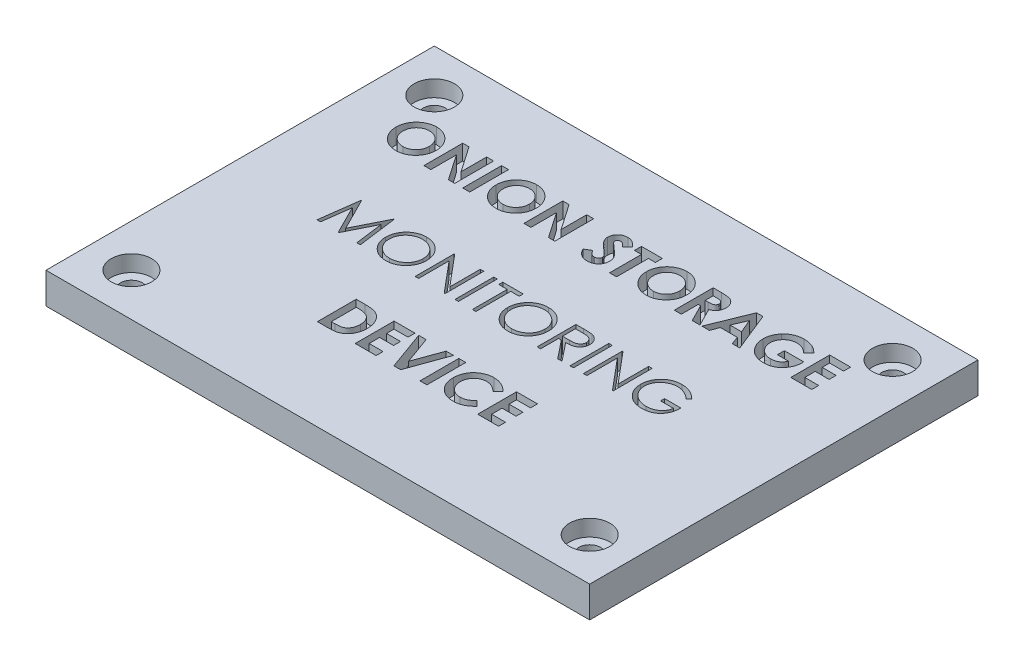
from build123d import *

# Parameters (mm, degrees)
SKETCH1_W           = 70
SKETCH1_H           = 50
BOSS_EXTRUDE1_DEPTH = 4
SKETCH2_R           = 1.4
CUT_EXTRUDE1_DEPTH  = 14
SKETCH3_R           = 2.6
CUT_EXTRUDE2_DEPTH  = 2.1
SKETCH4_W           = 0.897435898
SKETCH4_H           = 5
SKETCH4_W_2         = 0.448717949
CUT_EXTRUDE3_DEPTH  = 2


with BuildPart() as part:
    # Sketch1 → Boss-Extrude1 (new body)
    with BuildSketch(Plane(origin=(0, 0, 0), x_dir=(1, 0, 0), z_dir=(0, 1, 0))):
        Rectangle(SKETCH1_W, SKETCH1_H)
    extrude(amount=BOSS_EXTRUDE1_DEPTH)

    # Sketch2 → Cut-Extrude1 (cut)
    with BuildSketch(Plane(origin=(0, 4, 0), x_dir=(1, 0, 0), z_dir=(0, 1, 0))):
        with Locations(Location((-29.5, 19.5, 0), (0, 0, 270))):
            Circle(SKETCH2_R)
        with Locations(Location((29.5, 19.5, 0), (0, 0, 270))):
            Circle(SKETCH2_R)
        with Locations(Location((29.5, -19.5, 0), (0, 0, 270))):
            Circle(SKETCH2_R)
        with Locations(Location((-29.5, -19.5, 0), (0, 0, 270))):
            Circle(SKETCH2_R)
    extrude(amount=-CUT_EXTRUDE1_DEPTH, mode=Mode.SUBTRACT)

    # Sketch3 → Cut-Extrude2 (cut)
    with BuildSketch(Plane(origin=(0, 4, 0), x_dir=(1, 0, 0), z_dir=(0, 1, 0))):
        with Locations(Location((-29.5, 19.5, 0), (0, 0, 270))):
            Circle(SKETCH3_R)
        with Locations(Location((29.5, 19.5, 0), (0, 0, 90))):
            Circle(SKETCH3_R)
        with Locations(Location((29.5, -19.5, 0), (0, 0, 270))):
            Circle(SKETCH3_R)
        with Locations(Location((-29.5, -19.5, 0), (0, 0, 90))):
            Circle(SKETCH3_R)
    extrude(amount=-CUT_EXTRUDE2_DEPTH, mode=Mode.SUBTRACT)

    # Sketch4 → Cut-Extrude3 (cut)
    # profile 1 of 28: a face of its own
    with BuildSketch(Plane(origin=(0, 4, 0), x_dir=(1, 0, 0), z_dir=(0, 1, 0))):
        with BuildLine():
            add(Edge.make_bspline(
                [(-25.823317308, 16.123966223), (-25.73638618, 16.12171542), (-25.564764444, 16.117271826), (-25.312370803, 16.080231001), (-25.069142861, 16.019878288), (-24.835190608, 15.935983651), (-24.611099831, 15.826274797), (-24.396080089, 15.693862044), (-24.19090157, 15.536246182), (-23.997666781, 15.357104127), (-23.819082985, 15.162294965), (-23.664340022, 14.952548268), (-23.5323809, 14.733298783), (-23.423012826, 14.503959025), (-23.339708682, 14.262940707), (-23.281250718, 14.011472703), (-23.243694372, 13.749626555), (-23.239374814, 13.571345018), (-23.237179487, 13.480737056)],
                knots=[0, 0, 0, 0, 1.014329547, 2.002516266, 2.970391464, 3.935626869, 4.897733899, 5.877609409, 6.878433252, 7.912639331, 8.949961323, 9.958554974, 10.949718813, 11.932905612, 12.9188844, 13.919928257, 14.942845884, 16, 16, 16, 16], degree=3))
            add(Edge.make_bspline(
                [(-23.237179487, 13.480737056), (-23.239517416, 13.391150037), (-23.244124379, 13.214615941), (-23.279717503, 12.955182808), (-23.339159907, 12.706408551), (-23.421051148, 12.467730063), (-23.528435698, 12.240303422), (-23.657821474, 12.02267654), (-23.812622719, 11.816869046), (-23.987193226, 11.622991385), (-24.179380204, 11.447005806), (-24.382936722, 11.291918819), (-24.596922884, 11.160503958), (-24.821025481, 11.052821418), (-25.05572509, 10.969252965), (-25.300441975, 10.910289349), (-25.555160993, 10.874455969), (-25.728382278, 10.869879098), (-25.81630609, 10.867555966)],
                knots=[0, 0, 0, 0, 1.051557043, 2.072126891, 3.067553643, 4.050577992, 5.02905126, 6.015227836, 7.017913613, 8.04756643, 9.074058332, 10.072836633, 11.047628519, 12.017157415, 12.98668631, 13.966869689, 14.968021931, 16, 16, 16, 16], degree=3))
            add(Edge.make_bspline(
                [(-25.81630609, 10.867555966), (-25.908263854, 10.86963993), (-26.088948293, 10.873734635), (-26.353380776, 10.912673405), (-26.606729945, 10.971328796), (-26.846867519, 11.05886882), (-27.076239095, 11.168301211), (-27.293159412, 11.303073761), (-27.497555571, 11.462963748), (-27.688255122, 11.643876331), (-27.861029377, 11.841834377), (-28.013536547, 12.050959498), (-28.142179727, 12.269654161), (-28.246963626, 12.498020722), (-28.329571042, 12.734639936), (-28.387841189, 12.980952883), (-28.422262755, 13.236368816), (-28.427057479, 13.409852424), (-28.429487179, 13.497764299)],
                knots=[0, 0, 0, 0, 1.067978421, 2.098431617, 3.099715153, 4.085208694, 5.062210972, 6.048429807, 7.046490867, 8.072918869, 9.098532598, 10.095778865, 11.076610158, 12.041847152, 13.011192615, 13.984257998, 14.978533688, 16, 16, 16, 16], degree=3))
            add(Edge.make_bspline(
                [(-28.429487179, 13.497764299), (-28.4287246, 13.556906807), (-28.427209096, 13.674442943), (-28.408953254, 13.848625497), (-28.382670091, 14.019408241), (-28.34379854, 14.186110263), (-28.29657954, 14.349907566), (-28.235400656, 14.509275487), (-28.16576253, 14.665916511), (-28.084396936, 14.817980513), (-27.993926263, 14.964068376), (-27.895214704, 15.103490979), (-27.788014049, 15.234562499), (-27.672669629, 15.358144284), (-27.54878395, 15.473424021), (-27.4179866, 15.582033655), (-27.277740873, 15.68108813), (-27.131116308, 15.773006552), (-26.978939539, 15.856126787), (-26.821830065, 15.926876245), (-26.663024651, 15.988660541), (-26.500401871, 16.03742344), (-26.335704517, 16.077140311), (-26.167173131, 16.103405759), (-25.9963303, 16.121661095), (-25.88112517, 16.123196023), (-25.823317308, 16.123966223)],
                knots=[0, 0, 0, 0, 1.034744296, 2.056386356, 3.06226378, 4.057406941, 5.050368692, 6.043467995, 7.042652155, 8.049140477, 9.059438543, 10.048523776, 11.036952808, 12.020949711, 13.004946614, 13.997082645, 14.994316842, 16.007702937, 17.024872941, 18.026463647, 19.021641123, 20.005082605, 20.995858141, 21.984425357, 22.988620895, 24, 24, 24, 24], degree=3))
        make_face()
        with BuildLine():
            add(Edge.make_bspline(
                [(-25.837339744, 15.226530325), (-25.895844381, 15.224960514), (-26.011309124, 15.221862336), (-26.180674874, 15.198258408), (-26.343271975, 15.160560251), (-26.498199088, 15.105954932), (-26.646127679, 15.03645622), (-26.78731998, 14.952306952), (-26.91982077, 14.85061459), (-27.045396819, 14.736838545), (-27.158834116, 14.610065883), (-27.259059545, 14.474207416), (-27.342932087, 14.329490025), (-27.413175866, 14.1772581), (-27.466053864, 14.015799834), (-27.503717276, 13.846379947), (-27.527519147, 13.66870652), (-27.530519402, 13.547586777), (-27.532051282, 13.485745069)],
                knots=[0, 0, 0, 0, 1.033739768, 2.040188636, 3.016340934, 3.979330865, 4.937572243, 5.900995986, 6.878200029, 7.884839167, 8.891893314, 9.879764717, 10.863503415, 11.843163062, 12.837761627, 13.859916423, 14.907309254, 16, 16, 16, 16], degree=3))
            add(Edge.make_bspline(
                [(-27.532051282, 13.485745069), (-27.530020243, 13.417210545), (-27.526039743, 13.282894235), (-27.498032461, 13.086957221), (-27.45011479, 12.901914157), (-27.380922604, 12.728670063), (-27.29510614, 12.565301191), (-27.188535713, 12.413809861), (-27.062937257, 12.273289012), (-26.966177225, 12.191247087), (-26.917067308, 12.149607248)],
                knots=[0, 0, 0, 0, 1.078454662, 2.113592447, 3.107694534, 4.079536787, 5.043276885, 6.005368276, 6.987637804, 8, 8, 8, 8], degree=3))
            add(Edge.make_bspline(
                [(-26.917067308, 12.149607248), (-26.87683691, 12.118845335), (-26.797282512, 12.058014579), (-26.670296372, 11.980047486), (-26.539525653, 11.91322191), (-26.403983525, 11.859227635), (-26.263956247, 11.816756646), (-26.11946302, 11.78701491), (-25.97070858, 11.768349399), (-25.870113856, 11.766118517), (-25.819310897, 11.764991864)],
                knots=[0, 0, 0, 0, 1.023928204, 2.024787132, 3.009472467, 3.9914905, 4.972207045, 5.96565515, 6.972602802, 8, 8, 8, 8], degree=3))
            add(Edge.make_bspline(
                [(-25.819310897, 11.764991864), (-25.761812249, 11.766574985), (-25.648681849, 11.769689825), (-25.482468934, 11.793003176), (-25.323231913, 11.832457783), (-25.169982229, 11.886584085), (-25.023161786, 11.956955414), (-24.883488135, 12.043714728), (-24.750716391, 12.145796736), (-24.625300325, 12.26106691), (-24.510664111, 12.388338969), (-24.410647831, 12.524922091), (-24.324108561, 12.667806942), (-24.255325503, 12.81901584), (-24.200358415, 12.977121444), (-24.163148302, 13.142823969), (-24.139145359, 13.315440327), (-24.136144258, 13.432911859), (-24.134615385, 13.492756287)],
                knots=[0, 0, 0, 0, 1.026359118, 2.019393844, 2.989460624, 3.950973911, 4.916101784, 5.890408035, 6.881132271, 7.902007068, 8.92769091, 9.933912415, 10.920395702, 11.90457117, 12.894218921, 13.903490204, 14.931958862, 16, 16, 16, 16], degree=3))
            add(Edge.make_bspline(
                [(-24.134615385, 13.492756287), (-24.136197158, 13.552256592), (-24.139310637, 13.669373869), (-24.162665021, 13.841546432), (-24.201869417, 14.006517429), (-24.256158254, 14.164556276), (-24.325482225, 14.31581791), (-24.411208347, 14.459770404), (-24.513035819, 14.596274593), (-24.628621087, 14.724400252), (-24.754428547, 14.842139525), (-24.889495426, 14.944315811), (-25.030042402, 15.033103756), (-25.179294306, 15.102656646), (-25.334197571, 15.158069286), (-25.495697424, 15.19887595), (-25.664405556, 15.221696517), (-25.779181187, 15.224904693), (-25.837339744, 15.226530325)],
                knots=[0, 0, 0, 0, 1.055025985, 2.07665775, 3.074803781, 4.057872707, 5.035505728, 6.020516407, 7.023567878, 8.050795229, 9.077271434, 10.074415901, 11.050397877, 12.019801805, 12.988065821, 13.964604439, 14.968634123, 16, 16, 16, 16], degree=3))
        make_face(mode=Mode.SUBTRACT)
    # profile 2 of 28: a face of its own
    with BuildSketch(Plane(origin=(0, 4, 0), x_dir=(1, 0, 0), z_dir=(0, 1, 0))):
        Polygon((-22.33974359, 15.995761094), (-21.531450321, 15.995761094), (-19.262820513, 12.705496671), (-19.262820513, 15.995761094), (-18.365384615, 15.995761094), (-18.365384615, 10.995761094), (-19.1796875, 10.995761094), (-21.442307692, 14.276009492), (-21.442307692, 10.995761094), (-22.33974359, 10.995761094), align=None)
    # profile 3 of 28: a face of its own
    with BuildSketch(Plane(origin=(0, 4, 0), x_dir=(1, 0, 0), z_dir=(0, 1, 0))):
        with Locations((-16.891025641, 13.495761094)):
            Rectangle(SKETCH4_W, SKETCH4_H)
    # profile 4 of 28: a face of its own
    with BuildSketch(Plane(origin=(0, 4, 0), x_dir=(1, 0, 0), z_dir=(0, 1, 0))):
        with BuildLine():
            add(Edge.make_bspline(
                [(-12.938701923, 16.123966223), (-12.851770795, 16.12171542), (-12.680149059, 16.117271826), (-12.427755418, 16.080231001), (-12.184527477, 16.019878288), (-11.950575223, 15.935983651), (-11.726484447, 15.826274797), (-11.511464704, 15.693862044), (-11.306286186, 15.536246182), (-11.113051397, 15.357104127), (-10.934467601, 15.162294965), (-10.779724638, 14.952548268), (-10.647765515, 14.733298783), (-10.538397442, 14.503959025), (-10.455093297, 14.262940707), (-10.396635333, 14.011472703), (-10.359078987, 13.749626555), (-10.35475943, 13.571345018), (-10.352564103, 13.480737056)],
                knots=[0, 0, 0, 0, 1.014329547, 2.002516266, 2.970391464, 3.935626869, 4.897733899, 5.877609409, 6.878433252, 7.912639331, 8.949961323, 9.958554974, 10.949718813, 11.932905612, 12.9188844, 13.919928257, 14.942845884, 16, 16, 16, 16], degree=3))
            add(Edge.make_bspline(
                [(-10.352564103, 13.480737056), (-10.354902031, 13.391150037), (-10.359508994, 13.214615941), (-10.395102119, 12.955182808), (-10.454544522, 12.706408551), (-10.536435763, 12.467730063), (-10.643820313, 12.240303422), (-10.773206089, 12.02267654), (-10.928007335, 11.816869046), (-11.102577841, 11.622991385), (-11.294764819, 11.447005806), (-11.498321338, 11.291918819), (-11.712307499, 11.160503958), (-11.936410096, 11.052821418), (-12.171109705, 10.969252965), (-12.415826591, 10.910289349), (-12.670545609, 10.874455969), (-12.843766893, 10.869879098), (-12.931690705, 10.867555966)],
                knots=[0, 0, 0, 0, 1.051557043, 2.072126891, 3.067553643, 4.050577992, 5.02905126, 6.015227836, 7.017913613, 8.04756643, 9.074058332, 10.072836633, 11.047628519, 12.017157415, 12.98668631, 13.966869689, 14.968021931, 16, 16, 16, 16], degree=3))
            add(Edge.make_bspline(
                [(-12.931690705, 10.867555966), (-13.02364847, 10.86963993), (-13.204332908, 10.873734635), (-13.468765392, 10.912673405), (-13.72211456, 10.971328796), (-13.962252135, 11.05886882), (-14.19162371, 11.168301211), (-14.408544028, 11.303073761), (-14.612940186, 11.462963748), (-14.803639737, 11.643876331), (-14.976413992, 11.841834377), (-15.128921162, 12.050959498), (-15.257564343, 12.269654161), (-15.362348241, 12.498020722), (-15.444955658, 12.734639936), (-15.503225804, 12.980952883), (-15.53764737, 13.236368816), (-15.542442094, 13.409852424), (-15.544871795, 13.497764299)],
                knots=[0, 0, 0, 0, 1.067978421, 2.098431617, 3.099715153, 4.085208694, 5.062210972, 6.048429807, 7.046490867, 8.072918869, 9.098532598, 10.095778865, 11.076610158, 12.041847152, 13.011192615, 13.984257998, 14.978533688, 16, 16, 16, 16], degree=3))
            add(Edge.make_bspline(
                [(-15.544871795, 13.497764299), (-15.544109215, 13.556906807), (-15.542593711, 13.674442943), (-15.524337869, 13.848625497), (-15.498054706, 14.019408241), (-15.459183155, 14.186110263), (-15.411964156, 14.349907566), (-15.350785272, 14.509275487), (-15.281147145, 14.665916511), (-15.199781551, 14.817980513), (-15.109310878, 14.964068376), (-15.010599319, 15.103490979), (-14.903398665, 15.234562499), (-14.788054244, 15.358144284), (-14.664168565, 15.473424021), (-14.533371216, 15.582033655), (-14.393125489, 15.68108813), (-14.246500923, 15.773006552), (-14.094324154, 15.856126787), (-13.93721468, 15.926876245), (-13.778409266, 15.988660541), (-13.615786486, 16.03742344), (-13.451089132, 16.077140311), (-13.282557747, 16.103405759), (-13.111714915, 16.121661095), (-12.996509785, 16.123196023), (-12.938701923, 16.123966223)],
                knots=[0, 0, 0, 0, 1.034744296, 2.056386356, 3.06226378, 4.057406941, 5.050368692, 6.043467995, 7.042652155, 8.049140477, 9.059438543, 10.048523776, 11.036952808, 12.020949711, 13.004946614, 13.997082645, 14.994316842, 16.007702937, 17.024872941, 18.026463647, 19.021641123, 20.005082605, 20.995858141, 21.984425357, 22.988620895, 24, 24, 24, 24], degree=3))
        make_face()
        with BuildLine():
            add(Edge.make_bspline(
                [(-12.952724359, 15.226530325), (-13.011228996, 15.224960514), (-13.12669374, 15.221862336), (-13.29605949, 15.198258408), (-13.458656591, 15.160560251), (-13.613583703, 15.105954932), (-13.761512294, 15.03645622), (-13.902704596, 14.952306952), (-14.035205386, 14.85061459), (-14.160781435, 14.736838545), (-14.274218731, 14.610065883), (-14.374444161, 14.474207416), (-14.458316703, 14.329490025), (-14.528560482, 14.1772581), (-14.581438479, 14.015799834), (-14.619101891, 13.846379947), (-14.642903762, 13.66870652), (-14.645904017, 13.547586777), (-14.647435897, 13.485745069)],
                knots=[0, 0, 0, 0, 1.033739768, 2.040188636, 3.016340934, 3.979330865, 4.937572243, 5.900995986, 6.878200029, 7.884839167, 8.891893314, 9.879764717, 10.863503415, 11.843163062, 12.837761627, 13.859916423, 14.907309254, 16, 16, 16, 16], degree=3))
            add(Edge.make_bspline(
                [(-14.647435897, 13.485745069), (-14.645404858, 13.417210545), (-14.641424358, 13.282894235), (-14.613417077, 13.086957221), (-14.565499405, 12.901914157), (-14.496307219, 12.728670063), (-14.410490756, 12.565301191), (-14.303920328, 12.413809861), (-14.178321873, 12.273289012), (-14.08156184, 12.191247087), (-14.032451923, 12.149607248)],
                knots=[0, 0, 0, 0, 1.078454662, 2.113592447, 3.107694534, 4.079536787, 5.043276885, 6.005368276, 6.987637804, 8, 8, 8, 8], degree=3))
            add(Edge.make_bspline(
                [(-14.032451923, 12.149607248), (-13.992221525, 12.118845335), (-13.912667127, 12.058014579), (-13.785680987, 11.980047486), (-13.654910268, 11.91322191), (-13.519368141, 11.859227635), (-13.379340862, 11.816756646), (-13.234847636, 11.78701491), (-13.086093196, 11.768349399), (-12.985498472, 11.766118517), (-12.934695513, 11.764991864)],
                knots=[0, 0, 0, 0, 1.023928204, 2.024787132, 3.009472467, 3.9914905, 4.972207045, 5.96565515, 6.972602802, 8, 8, 8, 8], degree=3))
            add(Edge.make_bspline(
                [(-12.934695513, 11.764991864), (-12.877196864, 11.766574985), (-12.764066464, 11.769689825), (-12.597853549, 11.793003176), (-12.438616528, 11.832457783), (-12.285366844, 11.886584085), (-12.138546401, 11.956955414), (-11.998872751, 12.043714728), (-11.866101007, 12.145796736), (-11.74068494, 12.26106691), (-11.626048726, 12.388338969), (-11.526032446, 12.524922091), (-11.439493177, 12.667806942), (-11.370710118, 12.81901584), (-11.31574303, 12.977121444), (-11.278532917, 13.142823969), (-11.254529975, 13.315440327), (-11.251528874, 13.432911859), (-11.25, 13.492756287)],
                knots=[0, 0, 0, 0, 1.026359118, 2.019393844, 2.989460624, 3.950973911, 4.916101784, 5.890408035, 6.881132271, 7.902007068, 8.92769091, 9.933912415, 10.920395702, 11.90457117, 12.894218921, 13.903490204, 14.931958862, 16, 16, 16, 16], degree=3))
            add(Edge.make_bspline(
                [(-11.25, 13.492756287), (-11.251581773, 13.552256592), (-11.254695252, 13.669373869), (-11.278049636, 13.841546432), (-11.317254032, 14.006517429), (-11.37154287, 14.164556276), (-11.44086684, 14.31581791), (-11.526592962, 14.459770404), (-11.628420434, 14.596274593), (-11.744005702, 14.724400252), (-11.869813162, 14.842139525), (-12.004880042, 14.944315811), (-12.145427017, 15.033103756), (-12.294678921, 15.102656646), (-12.449582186, 15.158069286), (-12.611082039, 15.19887595), (-12.779790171, 15.221696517), (-12.894565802, 15.224904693), (-12.952724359, 15.226530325)],
                knots=[0, 0, 0, 0, 1.055025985, 2.07665775, 3.074803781, 4.057872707, 5.035505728, 6.020516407, 7.023567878, 8.050795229, 9.077271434, 10.074415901, 11.050397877, 12.019801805, 12.988065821, 13.964604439, 14.968634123, 16, 16, 16, 16], degree=3))
        make_face(mode=Mode.SUBTRACT)
    # profile 5 of 28: a face of its own
    with BuildSketch(Plane(origin=(0, 4, 0), x_dir=(1, 0, 0), z_dir=(0, 1, 0))):
        Polygon((-9.455128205, 15.995761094), (-8.646834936, 15.995761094), (-6.378205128, 12.705496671), (-6.378205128, 15.995761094), (-5.480769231, 15.995761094), (-5.480769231, 10.995761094), (-6.295072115, 10.995761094), (-8.557692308, 14.276009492), (-8.557692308, 10.995761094), (-9.455128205, 10.995761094), align=None)
    # profile 6 of 28: a face of its own
    with BuildSketch(Plane(origin=(0, 4, 0), x_dir=(1, 0, 0), z_dir=(0, 1, 0))):
        with BuildLine():
            Line((0.16025641, 15.327692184), (-0.510817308, 14.713709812))
            add(Edge.make_bspline(
                [(-0.510817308, 14.713709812), (-0.539563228, 14.754258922), (-0.594751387, 14.832107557), (-0.684205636, 14.936348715), (-0.773255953, 15.02527418), (-0.862727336, 15.098512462), (-0.953412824, 15.155618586), (-1.045155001, 15.196050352), (-1.137433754, 15.22175321), (-1.199430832, 15.224953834), (-1.229967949, 15.226530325)],
                knots=[0, 0, 0, 0, 1.299362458, 2.494594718, 3.587462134, 4.587049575, 5.512617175, 6.380583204, 7.202344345, 8, 8, 8, 8], degree=3))
            add(Edge.make_bspline(
                [(-1.229967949, 15.226530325), (-1.258452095, 15.225531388), (-1.313447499, 15.223602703), (-1.391847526, 15.204431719), (-1.461452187, 15.171345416), (-1.52219355, 15.128082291), (-1.570309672, 15.075960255), (-1.608726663, 15.021297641), (-1.630358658, 14.960962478), (-1.633205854, 14.919521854), (-1.634615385, 14.899006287)],
                knots=[0, 0, 0, 0, 1.185010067, 2.2879431, 3.333075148, 4.379039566, 5.372662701, 6.27520591, 7.14612461, 8, 8, 8, 8], degree=3))
            add(Edge.make_bspline(
                [(-1.634615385, 14.899006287), (-1.633732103, 14.878194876), (-1.631953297, 14.836283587), (-1.614772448, 14.774857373), (-1.588876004, 14.714836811), (-1.564130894, 14.678299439), (-1.551482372, 14.659623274)],
                knots=[0, 0, 0, 0, 0.967525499, 1.948461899, 2.951351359, 4, 4, 4, 4], degree=3))
            add(Edge.make_bspline(
                [(-1.551482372, 14.659623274), (-1.539983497, 14.645106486), (-1.513514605, 14.611690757), (-1.463043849, 14.558765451), (-1.399663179, 14.493927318), (-1.320933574, 14.419405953), (-1.230123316, 14.332521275), (-1.123023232, 14.236688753), (-1.00271613, 14.128940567), (-0.917204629, 14.053908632), (-0.872395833, 14.014591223)],
                knots=[0, 0, 0, 0, 0.473873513, 1.090794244, 1.870441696, 2.795289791, 3.865433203, 5.087734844, 6.473946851, 8, 8, 8, 8], degree=3))
            add(Edge.make_bspline(
                [(-0.872395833, 14.014591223), (-0.830336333, 13.978190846), (-0.750516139, 13.909110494), (-0.636947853, 13.811062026), (-0.537140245, 13.722850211), (-0.449639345, 13.645798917), (-0.375771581, 13.579099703), (-0.315226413, 13.522433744), (-0.267264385, 13.476904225), (-0.24000078, 13.449404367), (-0.228365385, 13.437668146)],
                knots=[0, 0, 0, 0, 1.543621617, 2.929473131, 4.163658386, 5.240097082, 6.164993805, 6.925417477, 7.541396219, 8, 8, 8, 8], degree=3))
            add(Edge.make_bspline(
                [(-0.228365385, 13.437668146), (-0.184223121, 13.389896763), (-0.099366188, 13.298063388), (0.01091791, 13.155750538), (0.10168529, 13.016824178), (0.171904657, 12.878670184), (0.224937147, 12.739295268), (0.262325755, 12.595281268), (0.284718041, 12.445123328), (0.287204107, 12.342658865), (0.288461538, 12.29083321)],
                knots=[0, 0, 0, 0, 1.206664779, 2.319633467, 3.337109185, 4.282041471, 5.190008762, 6.099243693, 7.03861361, 8, 8, 8, 8], degree=3))
            add(Edge.make_bspline(
                [(0.288461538, 12.29083321), (0.287566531, 12.240335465), (0.285810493, 12.14125701), (0.264302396, 11.996270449), (0.233633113, 11.857512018), (0.18621302, 11.726491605), (0.128417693, 11.601058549), (0.055962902, 11.483166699), (-0.029125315, 11.37162294), (-0.126649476, 11.268421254), (-0.234522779, 11.174772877), (-0.350227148, 11.09140488), (-0.474894, 11.02257398), (-0.607458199, 10.965896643), (-0.747848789, 10.922243), (-0.89589852, 10.88997889), (-1.051833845, 10.870614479), (-1.158464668, 10.86859016), (-1.212940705, 10.867555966)],
                knots=[0, 0, 0, 0, 1.043214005, 2.046824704, 3.02475056, 3.976699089, 4.921714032, 5.875962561, 6.831408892, 7.817874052, 8.806269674, 9.781291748, 10.760897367, 11.74438705, 12.757449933, 13.795994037, 14.874007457, 16, 16, 16, 16], degree=3))
            add(Edge.make_bspline(
                [(-1.212940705, 10.867555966), (-1.255703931, 10.868314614), (-1.340399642, 10.869817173), (-1.465228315, 10.882084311), (-1.58576451, 10.901882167), (-1.701872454, 10.930258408), (-1.814075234, 10.966214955), (-1.922377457, 11.010134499), (-2.026031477, 11.062697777), (-2.125821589, 11.12282388), (-2.221262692, 11.192638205), (-2.313561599, 11.270713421), (-2.40180151, 11.358250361), (-2.486406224, 11.455042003), (-2.566834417, 11.561362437), (-2.645718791, 11.675730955), (-2.719553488, 11.800270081), (-2.765164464, 11.887635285), (-2.788461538, 11.932259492)],
                knots=[0, 0, 0, 0, 1.016823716, 2.013894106, 2.979844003, 3.91962641, 4.853723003, 5.779685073, 6.695824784, 7.614987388, 8.547259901, 9.504950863, 10.487499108, 11.500346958, 12.559593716, 13.656357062, 14.802919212, 16, 16, 16, 16], degree=3))
            Line((-2.788461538, 11.932259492), (-1.999198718, 12.406017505))
            add(Edge.make_bspline(
                [(-1.999198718, 12.406017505), (-1.97005756, 12.355363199), (-1.914191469, 12.258254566), (-1.819521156, 12.127776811), (-1.722536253, 12.016044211), (-1.620994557, 11.925031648), (-1.516130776, 11.853522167), (-1.407438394, 11.802416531), (-1.294841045, 11.7707822), (-1.218144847, 11.766918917), (-1.179887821, 11.764991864)],
                knots=[0, 0, 0, 0, 1.283663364, 2.460892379, 3.537111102, 4.529833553, 5.449777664, 6.316464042, 7.160231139, 8, 8, 8, 8], degree=3))
            add(Edge.make_bspline(
                [(-1.179887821, 11.764991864), (-1.140974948, 11.7665656), (-1.065478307, 11.769618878), (-0.957716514, 11.797821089), (-0.858916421, 11.842100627), (-0.773514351, 11.905281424), (-0.701201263, 11.978201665), (-0.647830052, 12.059328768), (-0.614301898, 12.147106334), (-0.610757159, 12.208082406), (-0.608974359, 12.238749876)],
                knots=[0, 0, 0, 0, 1.13588714, 2.203786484, 3.234766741, 4.283437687, 5.291419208, 6.222934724, 7.106237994, 8, 8, 8, 8], degree=3))
            add(Edge.make_bspline(
                [(-0.608974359, 12.238749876), (-0.610620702, 12.267280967), (-0.613965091, 12.325239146), (-0.638598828, 12.411413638), (-0.677108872, 12.49754894), (-0.722668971, 12.568199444), (-0.769032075, 12.627353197), (-0.813365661, 12.678607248), (-0.86735224, 12.735234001), (-0.930854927, 12.797304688), (-1.003034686, 12.865365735), (-1.083952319, 12.939410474), (-1.174534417, 13.018786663), (-1.238558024, 13.072856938), (-1.272035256, 13.101129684)],
                knots=[0, 0, 0, 0, 0.916159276, 1.861089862, 2.860218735, 3.940849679, 4.552606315, 5.27541173, 6.11797699, 7.06649574, 8.129236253, 9.306560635, 10.591630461, 12, 12, 12, 12], degree=3))
            add(Edge.make_bspline(
                [(-1.272035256, 13.101129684), (-1.335676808, 13.15497654), (-1.45782421, 13.258324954), (-1.630433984, 13.410967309), (-1.785970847, 13.553625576), (-1.923091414, 13.688063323), (-2.043542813, 13.811797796), (-2.146509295, 13.925834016), (-2.230859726, 14.031051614), (-2.319620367, 14.155674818), (-2.403960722, 14.307536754), (-2.476854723, 14.490244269), (-2.524145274, 14.672928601), (-2.529443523, 14.7955728), (-2.532051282, 14.855937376)],
                knots=[0, 0, 0, 0, 1.345494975, 2.582412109, 3.71882943, 4.751509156, 5.681369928, 6.505683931, 7.230279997, 7.856715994, 8.973648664, 10.023341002, 11.027102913, 12, 12, 12, 12], degree=3))
            add(Edge.make_bspline(
                [(-2.532051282, 14.855937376), (-2.530966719, 14.898744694), (-2.528830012, 14.983079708), (-2.509770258, 15.107082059), (-2.481284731, 15.226733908), (-2.439915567, 15.341598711), (-2.386223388, 15.451532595), (-2.321016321, 15.557073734), (-2.243281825, 15.65725075), (-2.155680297, 15.751997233), (-2.059165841, 15.838584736), (-1.956027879, 15.915006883), (-1.846850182, 15.97955414), (-1.732300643, 16.033100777), (-1.611669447, 16.074087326), (-1.485845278, 16.103140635), (-1.354647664, 16.120420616), (-1.265409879, 16.122769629), (-1.219951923, 16.123966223)],
                knots=[0, 0, 0, 0, 1.010766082, 1.991317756, 2.957454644, 3.913069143, 4.869106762, 5.843196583, 6.838735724, 7.860187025, 8.887984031, 9.89767229, 10.887916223, 11.879572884, 12.879850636, 13.892031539, 14.926195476, 16, 16, 16, 16], degree=3))
            add(Edge.make_bspline(
                [(-1.219951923, 16.123966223), (-1.161040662, 16.121811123), (-1.043683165, 16.117517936), (-0.870166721, 16.083946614), (-0.700683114, 16.031152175), (-0.564110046, 15.967461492), (-0.455441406, 15.905764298), (-0.372157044, 15.848961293), (-0.287410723, 15.783890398), (-0.200519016, 15.710346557), (-0.113096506, 15.626944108), (-0.022657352, 15.535668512), (0.069566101, 15.435730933), (0.129496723, 15.364335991), (0.16025641, 15.327692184)],
                knots=[0, 0, 0, 0, 1.282922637, 2.555718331, 3.837320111, 5.142675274, 5.830281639, 6.55870424, 7.337177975, 8.157850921, 9.037902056, 9.96903443, 10.957596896, 12, 12, 12, 12], degree=3))
        make_face()
    # profile 7 of 28: a face of its own
    with BuildSketch(Plane(origin=(0, 4, 0), x_dir=(1, 0, 0), z_dir=(0, 1, 0))):
        Polygon((0.673076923, 15.995761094), (3.365384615, 15.995761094), (3.365384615, 15.098325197), (2.467948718, 15.098325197), (2.467948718, 10.995761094), (1.570512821, 10.995761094), (1.570512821, 15.098325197), (0.673076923, 15.098325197), align=None)
    # profile 8 of 28: a face of its own
    with BuildSketch(Plane(origin=(0, 4, 0), x_dir=(1, 0, 0), z_dir=(0, 1, 0))):
        with BuildLine():
            add(Edge.make_bspline(
                [(6.420272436, 16.123966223), (6.507203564, 16.12171542), (6.6788253, 16.117271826), (6.931218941, 16.080231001), (7.174446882, 16.019878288), (7.408399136, 15.935983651), (7.632489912, 15.826274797), (7.847509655, 15.693862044), (8.052688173, 15.536246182), (8.245922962, 15.357104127), (8.424506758, 15.162294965), (8.579249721, 14.952548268), (8.711208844, 14.733298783), (8.820576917, 14.503959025), (8.903881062, 14.262940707), (8.962339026, 14.011472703), (8.999895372, 13.749626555), (9.004214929, 13.571345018), (9.006410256, 13.480737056)],
                knots=[0, 0, 0, 0, 1.014329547, 2.002516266, 2.970391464, 3.935626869, 4.897733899, 5.877609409, 6.878433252, 7.912639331, 8.949961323, 9.958554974, 10.949718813, 11.932905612, 12.9188844, 13.919928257, 14.942845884, 16, 16, 16, 16], degree=3))
            add(Edge.make_bspline(
                [(9.006410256, 13.480737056), (9.004072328, 13.391150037), (8.999465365, 13.214615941), (8.96387224, 12.955182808), (8.904429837, 12.706408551), (8.822538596, 12.467730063), (8.715154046, 12.240303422), (8.58576827, 12.02267654), (8.430967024, 11.816869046), (8.256396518, 11.622991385), (8.06420954, 11.447005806), (7.860653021, 11.291918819), (7.64666686, 11.160503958), (7.422564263, 11.052821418), (7.187864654, 10.969252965), (6.943147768, 10.910289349), (6.68842875, 10.874455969), (6.515207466, 10.869879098), (6.427283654, 10.867555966)],
                knots=[0, 0, 0, 0, 1.051557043, 2.072126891, 3.067553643, 4.050577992, 5.02905126, 6.015227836, 7.017913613, 8.04756643, 9.074058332, 10.072836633, 11.047628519, 12.017157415, 12.98668631, 13.966869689, 14.968021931, 16, 16, 16, 16], degree=3))
            add(Edge.make_bspline(
                [(6.427283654, 10.867555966), (6.335325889, 10.86963993), (6.154641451, 10.873734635), (5.890208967, 10.912673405), (5.636859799, 10.971328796), (5.396722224, 11.05886882), (5.167350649, 11.168301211), (4.950430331, 11.303073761), (4.746034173, 11.462963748), (4.555334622, 11.643876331), (4.382560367, 11.841834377), (4.230053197, 12.050959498), (4.101410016, 12.269654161), (3.996626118, 12.498020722), (3.914018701, 12.734639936), (3.855748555, 12.980952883), (3.821326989, 13.236368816), (3.816532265, 13.409852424), (3.814102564, 13.497764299)],
                knots=[0, 0, 0, 0, 1.067978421, 2.098431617, 3.099715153, 4.085208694, 5.062210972, 6.048429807, 7.046490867, 8.072918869, 9.098532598, 10.095778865, 11.076610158, 12.041847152, 13.011192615, 13.984257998, 14.978533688, 16, 16, 16, 16], degree=3))
            add(Edge.make_bspline(
                [(3.814102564, 13.497764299), (3.814865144, 13.556906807), (3.816380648, 13.674442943), (3.83463649, 13.848625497), (3.860919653, 14.019408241), (3.899791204, 14.186110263), (3.947010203, 14.349907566), (4.008189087, 14.509275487), (4.077827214, 14.665916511), (4.159192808, 14.817980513), (4.249663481, 14.964068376), (4.34837504, 15.103490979), (4.455575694, 15.234562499), (4.570920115, 15.358144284), (4.694805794, 15.473424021), (4.825603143, 15.582033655), (4.96584887, 15.68108813), (5.112473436, 15.773006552), (5.264650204, 15.856126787), (5.421759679, 15.926876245), (5.580565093, 15.988660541), (5.743187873, 16.03742344), (5.907885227, 16.077140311), (6.076416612, 16.103405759), (6.247259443, 16.121661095), (6.362464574, 16.123196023), (6.420272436, 16.123966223)],
                knots=[0, 0, 0, 0, 1.034744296, 2.056386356, 3.06226378, 4.057406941, 5.050368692, 6.043467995, 7.042652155, 8.049140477, 9.059438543, 10.048523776, 11.036952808, 12.020949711, 13.004946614, 13.997082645, 14.994316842, 16.007702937, 17.024872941, 18.026463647, 19.021641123, 20.005082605, 20.995858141, 21.984425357, 22.988620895, 24, 24, 24, 24], degree=3))
        make_face()
        with BuildLine():
            add(Edge.make_bspline(
                [(6.40625, 15.226530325), (6.347745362, 15.224960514), (6.232280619, 15.221862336), (6.062914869, 15.198258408), (5.900317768, 15.160560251), (5.745390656, 15.105954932), (5.597462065, 15.03645622), (5.456269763, 14.952306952), (5.323768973, 14.85061459), (5.198192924, 14.736838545), (5.084755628, 14.610065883), (4.984530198, 14.474207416), (4.900657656, 14.329490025), (4.830413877, 14.1772581), (4.77753588, 14.015799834), (4.739872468, 13.846379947), (4.716070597, 13.66870652), (4.713070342, 13.547586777), (4.711538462, 13.485745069)],
                knots=[0, 0, 0, 0, 1.033739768, 2.040188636, 3.016340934, 3.979330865, 4.937572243, 5.900995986, 6.878200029, 7.884839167, 8.891893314, 9.879764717, 10.863503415, 11.843163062, 12.837761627, 13.859916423, 14.907309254, 16, 16, 16, 16], degree=3))
            add(Edge.make_bspline(
                [(4.711538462, 13.485745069), (4.713569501, 13.417210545), (4.717550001, 13.282894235), (4.745557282, 13.086957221), (4.793474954, 12.901914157), (4.86266714, 12.728670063), (4.948483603, 12.565301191), (5.055054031, 12.413809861), (5.180652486, 12.273289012), (5.277412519, 12.191247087), (5.326522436, 12.149607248)],
                knots=[0, 0, 0, 0, 1.078454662, 2.113592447, 3.107694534, 4.079536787, 5.043276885, 6.005368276, 6.987637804, 8, 8, 8, 8], degree=3))
            add(Edge.make_bspline(
                [(5.326522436, 12.149607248), (5.366752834, 12.118845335), (5.446307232, 12.058014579), (5.573293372, 11.980047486), (5.704064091, 11.91322191), (5.839606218, 11.859227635), (5.979633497, 11.816756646), (6.124126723, 11.78701491), (6.272881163, 11.768349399), (6.373475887, 11.766118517), (6.424278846, 11.764991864)],
                knots=[0, 0, 0, 0, 1.023928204, 2.024787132, 3.009472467, 3.9914905, 4.972207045, 5.96565515, 6.972602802, 8, 8, 8, 8], degree=3))
            add(Edge.make_bspline(
                [(6.424278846, 11.764991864), (6.481777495, 11.766574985), (6.594907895, 11.769689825), (6.76112081, 11.793003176), (6.920357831, 11.832457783), (7.073607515, 11.886584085), (7.220427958, 11.956955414), (7.360101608, 12.043714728), (7.492873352, 12.145796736), (7.618289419, 12.26106691), (7.732925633, 12.388338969), (7.832941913, 12.524922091), (7.919481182, 12.667806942), (7.988264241, 12.81901584), (8.043231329, 12.977121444), (8.080441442, 13.142823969), (8.104444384, 13.315440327), (8.107445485, 13.432911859), (8.108974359, 13.492756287)],
                knots=[0, 0, 0, 0, 1.026359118, 2.019393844, 2.989460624, 3.950973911, 4.916101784, 5.890408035, 6.881132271, 7.902007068, 8.92769091, 9.933912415, 10.920395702, 11.90457117, 12.894218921, 13.903490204, 14.931958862, 16, 16, 16, 16], degree=3))
            add(Edge.make_bspline(
                [(8.108974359, 13.492756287), (8.107392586, 13.552256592), (8.104279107, 13.669373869), (8.080924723, 13.841546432), (8.041720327, 14.006517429), (7.987431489, 14.164556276), (7.918107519, 14.31581791), (7.832381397, 14.459770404), (7.730553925, 14.596274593), (7.614968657, 14.724400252), (7.489161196, 14.842139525), (7.354094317, 14.944315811), (7.213547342, 15.033103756), (7.064295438, 15.102656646), (6.909392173, 15.158069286), (6.74789232, 15.19887595), (6.579184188, 15.221696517), (6.464408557, 15.224904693), (6.40625, 15.226530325)],
                knots=[0, 0, 0, 0, 1.055025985, 2.07665775, 3.074803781, 4.057872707, 5.035505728, 6.020516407, 7.023567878, 8.050795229, 9.077271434, 10.074415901, 11.050397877, 12.019801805, 12.988065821, 13.964604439, 14.968634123, 16, 16, 16, 16], degree=3))
        make_face(mode=Mode.SUBTRACT)
    # profile 9 of 28: a face of its own
    with BuildSketch(Plane(origin=(0, 4, 0), x_dir=(1, 0, 0), z_dir=(0, 1, 0))):
        with BuildLine():
            Line((9.903846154, 15.995761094), (10.949519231, 15.995761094))
            add(Edge.make_bspline(
                [(10.949519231, 15.995761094), (11.018637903, 15.995515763), (11.151572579, 15.995043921), (11.343257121, 15.987599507), (11.519345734, 15.977239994), (11.680099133, 15.961431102), (11.825448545, 15.940470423), (11.955539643, 15.915761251), (12.070368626, 15.887599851), (12.170903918, 15.852508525), (12.261632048, 15.812926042), (12.346203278, 15.767445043), (12.426483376, 15.716571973), (12.501935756, 15.658968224), (12.573216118, 15.595670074), (12.640458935, 15.526613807), (12.702714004, 15.451213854), (12.75959584, 15.369946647), (12.811439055, 15.284455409), (12.857257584, 15.194622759), (12.894517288, 15.100386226), (12.92744023, 15.003107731), (12.951153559, 14.901396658), (12.967645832, 14.796243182), (12.979720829, 14.687277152), (12.980415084, 14.613250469), (12.980769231, 14.575488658)],
                knots=[0, 0, 0, 0, 1.749336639, 3.364467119, 4.854658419, 6.213483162, 7.451590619, 8.570285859, 9.5643256, 10.440900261, 11.26203566, 12.067320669, 12.869050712, 13.665104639, 14.467235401, 15.27997916, 16.102287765, 16.939272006, 17.78853747, 18.631303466, 19.488103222, 20.351255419, 21.228522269, 22.127379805, 23.044756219, 24, 24, 24, 24], degree=3))
            add(Edge.make_bspline(
                [(12.980769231, 14.575488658), (12.979849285, 14.536074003), (12.978045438, 14.458789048), (12.968328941, 14.345263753), (12.950570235, 14.236650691), (12.923672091, 14.133267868), (12.892756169, 14.033828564), (12.851645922, 13.940167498), (12.805248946, 13.850922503), (12.750144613, 13.767355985), (12.689670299, 13.687611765), (12.619339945, 13.614745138), (12.543709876, 13.5448398), (12.458528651, 13.482274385), (12.367551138, 13.422818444), (12.268969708, 13.368935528), (12.16342774, 13.319271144), (12.089226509, 13.291574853), (12.051282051, 13.277411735)],
                knots=[0, 0, 0, 0, 1.099860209, 2.156625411, 3.176576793, 4.16617041, 5.135385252, 6.078461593, 7.016046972, 7.938469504, 8.868247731, 9.803980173, 10.76021508, 11.73834243, 12.748633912, 13.790971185, 14.870363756, 16, 16, 16, 16], degree=3))
            Line((12.051282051, 13.277411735), (13.205128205, 10.995761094))
            Line((13.205128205, 10.995761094), (12.207532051, 10.995761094))
            Line((12.207532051, 10.995761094), (11.105769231, 13.175248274))
            Line((11.105769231, 13.175248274), (10.801282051, 13.175248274))
            Line((10.801282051, 13.175248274), (10.801282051, 10.995761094))
            Line((10.801282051, 10.995761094), (9.903846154, 10.995761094))
            Line((9.903846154, 10.995761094), (9.903846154, 15.995761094))
        make_face()
        with BuildLine():
            Line((10.801282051, 14.072684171), (11.150841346, 14.072684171))
            add(Edge.make_bspline(
                [(11.150841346, 14.072684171), (11.193577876, 14.073165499), (11.275409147, 14.074087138), (11.393093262, 14.07836208), (11.499978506, 14.08866258), (11.596523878, 14.101676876), (11.683215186, 14.11670376), (11.759279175, 14.138238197), (11.825887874, 14.161312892), (11.882251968, 14.189988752), (11.930408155, 14.222599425), (11.97198794, 14.259645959), (12.006380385, 14.302522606), (12.034687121, 14.350064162), (12.056706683, 14.402691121), (12.072779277, 14.459825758), (12.081761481, 14.522118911), (12.082794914, 14.565109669), (12.083333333, 14.587507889)],
                knots=[0, 0, 0, 0, 1.688639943, 3.233382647, 4.650958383, 5.928841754, 7.082724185, 8.122798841, 9.049171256, 9.863274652, 10.613301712, 11.341792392, 12.054588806, 12.776240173, 13.521029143, 14.301969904, 15.115324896, 16, 16, 16, 16], degree=3))
            add(Edge.make_bspline(
                [(12.083333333, 14.587507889), (12.082315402, 14.614006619), (12.080315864, 14.666058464), (12.060474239, 14.74099487), (12.028890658, 14.810353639), (11.985598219, 14.873821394), (11.931077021, 14.929461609), (11.868509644, 14.978508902), (11.796545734, 15.017291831), (11.729912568, 15.042872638), (11.669291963, 15.058177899), (11.614583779, 15.069583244), (11.551231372, 15.077666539), (11.479186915, 15.086240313), (11.398634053, 15.091799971), (11.309133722, 15.095857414), (11.210942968, 15.097517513), (11.142494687, 15.098048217), (11.106770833, 15.098325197)],
                knots=[0, 0, 0, 0, 1.020303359, 2.004196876, 2.966617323, 3.9489082, 4.950758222, 5.960522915, 7.003732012, 8.091992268, 8.70421221, 9.413913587, 10.24622431, 11.166358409, 12.212345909, 13.359657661, 14.621978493, 16, 16, 16, 16], degree=3))
            Line((11.106770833, 15.098325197), (10.801282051, 15.098325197))
            Line((10.801282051, 15.098325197), (10.801282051, 14.072684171))
        make_face(mode=Mode.SUBTRACT)
    # profile 10 of 28: a face of its own
    with BuildSketch(Plane(origin=(0, 4, 0), x_dir=(1, 0, 0), z_dir=(0, 1, 0))):
        Polygon((15.481770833, 15.995761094), (16.314102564, 15.995761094), (18.333333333, 10.995761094), (17.374799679, 10.995761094), (16.986177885, 12.02140212), (14.807692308, 12.02140212), (14.419070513, 10.995761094), (13.461538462, 10.995761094), align=None)
        Polygon((15.897435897, 14.654615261), (15.148237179, 12.918838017), (16.646634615, 12.918838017), align=None, mode=Mode.SUBTRACT)
    # profile 11 of 28: a face of its own
    with BuildSketch(Plane(origin=(0, 4, 0), x_dir=(1, 0, 0), z_dir=(0, 1, 0))):
        with BuildLine():
            Line((23.652844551, 15.200488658), (22.973758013, 14.550448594))
            add(Edge.make_bspline(
                [(22.973758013, 14.550448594), (22.919993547, 14.60427748), (22.814498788, 14.70989864), (22.641975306, 14.847371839), (22.463293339, 14.964251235), (22.277864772, 15.06035765), (22.085431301, 15.134906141), (21.886372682, 15.188233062), (21.680365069, 15.219862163), (21.540907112, 15.224290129), (21.470352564, 15.226530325)],
                knots=[0, 0, 0, 0, 1.075575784, 2.110457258, 3.113929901, 4.09197124, 5.059417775, 6.02750972, 7.002078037, 8, 8, 8, 8], degree=3))
            add(Edge.make_bspline(
                [(21.470352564, 15.226530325), (21.409183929, 15.22496063), (21.289073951, 15.221878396), (21.112583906, 15.198472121), (20.943936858, 15.159372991), (20.782336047, 15.105207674), (20.628768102, 15.034721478), (20.482343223, 14.949002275), (20.343962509, 14.847394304), (20.214715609, 14.731823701), (20.097035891, 14.605643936), (19.994295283, 14.470586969), (19.906782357, 14.329170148), (19.834741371, 14.180669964), (19.779926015, 14.025314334), (19.740795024, 13.86321604), (19.715956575, 13.694846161), (19.713023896, 13.579982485), (19.711538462, 13.521802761)],
                knots=[0, 0, 0, 0, 1.075001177, 2.110859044, 3.123021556, 4.114053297, 5.101481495, 6.087880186, 7.091499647, 8.114004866, 9.131394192, 10.11971144, 11.092043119, 12.050101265, 13.015322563, 13.981809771, 14.977764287, 16, 16, 16, 16], degree=3))
            add(Edge.make_bspline(
                [(19.711538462, 13.521802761), (19.712924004, 13.461609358), (19.715653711, 13.343020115), (19.741875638, 13.168985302), (19.782275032, 13.001551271), (19.841408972, 12.841960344), (19.914184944, 12.688026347), (20.006476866, 12.54273113), (20.114098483, 12.403855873), (20.236857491, 12.273818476), (20.370387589, 12.153955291), (20.51500503, 12.050558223), (20.666309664, 11.961348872), (20.826743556, 11.890697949), (20.993522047, 11.833972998), (21.168336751, 11.79397704), (21.350794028, 11.769439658), (21.475282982, 11.766489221), (21.538461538, 11.764991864)],
                knots=[0, 0, 0, 0, 1.022067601, 2.013613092, 2.983553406, 3.943623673, 4.90013463, 5.87121881, 6.861774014, 7.881098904, 8.905697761, 9.905387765, 10.89678721, 11.884561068, 12.87834324, 13.885584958, 14.926927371, 16, 16, 16, 16], degree=3))
            add(Edge.make_bspline(
                [(21.538461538, 11.764991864), (21.57955685, 11.765362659), (21.66023609, 11.766090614), (21.778578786, 11.777907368), (21.891922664, 11.794800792), (22.000706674, 11.817165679), (22.103832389, 11.848816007), (22.202727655, 11.885827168), (22.296813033, 11.929507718), (22.385578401, 11.981364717), (22.470344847, 12.039490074), (22.55031894, 12.105997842), (22.626903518, 12.179388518), (22.699203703, 12.26055867), (22.76599579, 12.350234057), (22.829419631, 12.446766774), (22.888749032, 12.551114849), (22.92380521, 12.624800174), (22.941706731, 12.662427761)],
                knots=[0, 0, 0, 0, 1.109579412, 2.178351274, 3.208885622, 4.204702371, 5.174744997, 6.119429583, 7.05542196, 7.97267548, 8.893247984, 9.828544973, 10.778894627, 11.756245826, 12.760884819, 13.796418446, 14.874735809, 16, 16, 16, 16], degree=3))
            Line((22.941706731, 12.662427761), (21.506410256, 12.662427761))
            Line((21.506410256, 12.662427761), (21.506410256, 13.559863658))
            Line((21.506410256, 13.559863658), (23.999399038, 13.559863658))
            Line((23.999399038, 13.559863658), (24.006410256, 13.346522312))
            add(Edge.make_bspline(
                [(24.006410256, 13.346522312), (24.005509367, 13.291730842), (24.003709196, 13.18224568), (23.987257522, 13.019240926), (23.960005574, 12.858398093), (23.922749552, 12.699878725), (23.876058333, 12.54290523), (23.816512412, 12.38898076), (23.746784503, 12.237061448), (23.668659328, 12.087792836), (23.580869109, 11.944565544), (23.486350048, 11.808948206), (23.386449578, 11.681175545), (23.278994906, 11.563027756), (23.165659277, 11.453512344), (23.04621959, 11.353050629), (22.920253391, 11.261557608), (22.788427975, 11.178260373), (22.649992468, 11.105255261), (22.505707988, 11.041750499), (22.355792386, 10.987817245), (22.199858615, 10.94360371), (22.038213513, 10.90948945), (21.870853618, 10.886097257), (21.697687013, 10.870201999), (21.580231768, 10.86844864), (21.520432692, 10.867555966)],
                knots=[0, 0, 0, 0, 1.006889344, 2.011981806, 3.007738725, 4.003571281, 5.003404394, 6.015442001, 7.03424805, 8.074616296, 9.110249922, 10.119753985, 11.111721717, 12.089233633, 13.052717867, 14.006597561, 14.955430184, 15.912305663, 16.870361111, 17.829300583, 18.807640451, 19.796414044, 20.806216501, 21.841577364, 22.90109906, 24, 24, 24, 24], degree=3))
            add(Edge.make_bspline(
                [(21.520432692, 10.867555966), (21.456631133, 10.868437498), (21.330157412, 10.870184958), (21.143149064, 10.886551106), (20.961565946, 10.913562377), (20.785362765, 10.950945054), (20.614130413, 10.997470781), (20.448163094, 11.055871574), (20.287800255, 11.125341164), (20.132561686, 11.20403997), (19.984431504, 11.29329127), (19.843741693, 11.391530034), (19.711260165, 11.499388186), (19.585629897, 11.615060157), (19.469786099, 11.741389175), (19.359411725, 11.874280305), (19.259854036, 12.018607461), (19.166832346, 12.169691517), (19.084191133, 12.327469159), (19.011920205, 12.489022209), (18.950287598, 12.653415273), (18.901688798, 12.821413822), (18.862231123, 12.991846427), (18.833998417, 13.165454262), (18.818054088, 13.342215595), (18.815425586, 13.461008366), (18.814102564, 13.520801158)],
                knots=[0, 0, 0, 0, 1.084149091, 2.14910686, 3.187506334, 4.202448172, 5.208724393, 6.201130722, 7.189831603, 8.176984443, 9.156919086, 10.126598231, 11.090766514, 12.05840148, 13.026036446, 14.001772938, 14.991905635, 16.003017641, 17.015720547, 18.016462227, 19.009322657, 19.99686681, 20.986544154, 21.980959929, 22.983742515, 24, 24, 24, 24], degree=3))
            add(Edge.make_bspline(
                [(18.814102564, 13.520801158), (18.815874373, 13.602371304), (18.819373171, 13.763448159), (18.85177735, 14.000715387), (18.902290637, 14.230247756), (18.97478229, 14.451209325), (19.067806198, 14.66390447), (19.180044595, 14.868832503), (19.313935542, 15.065775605), (19.41757633, 15.187710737), (19.470152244, 15.249567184)],
                knots=[0, 0, 0, 0, 1.034044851, 2.041932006, 3.031217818, 4.011390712, 4.986069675, 5.97149666, 6.970960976, 8, 8, 8, 8], degree=3))
            add(Edge.make_bspline(
                [(19.470152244, 15.249567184), (19.502796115, 15.285353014), (19.567593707, 15.356387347), (19.671172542, 15.455090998), (19.777378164, 15.547876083), (19.88768154, 15.63277515), (20.001502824, 15.711646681), (20.119169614, 15.783012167), (20.240064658, 15.849143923), (20.365130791, 15.90666501), (20.493713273, 15.958237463), (20.626381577, 16.001875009), (20.762142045, 16.040527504), (20.902196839, 16.069932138), (21.045131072, 16.094418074), (21.19195934, 16.11082983), (21.342281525, 16.122858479), (21.443951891, 16.123594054), (21.495392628, 16.123966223)],
                knots=[0, 0, 0, 0, 1.020590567, 2.025856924, 3.013483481, 3.991664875, 4.957826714, 5.930500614, 6.890802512, 7.860442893, 8.829981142, 9.809047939, 10.802672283, 11.803273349, 12.823572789, 13.857849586, 14.916166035, 16, 16, 16, 16], degree=3))
            add(Edge.make_bspline(
                [(21.495392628, 16.123966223), (21.549164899, 16.123136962), (21.656151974, 16.121487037), (21.815224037, 16.110070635), (21.972085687, 16.092457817), (22.126075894, 16.066037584), (22.277711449, 16.033455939), (22.426207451, 15.991710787), (22.572532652, 15.944280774), (22.667789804, 15.906466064), (22.715344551, 15.887588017)],
                knots=[0, 0, 0, 0, 1.03180557, 2.052914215, 3.058998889, 4.059601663, 5.049854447, 6.033765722, 7.018406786, 8, 8, 8, 8], degree=3))
            add(Edge.make_bspline(
                [(22.715344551, 15.887588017), (22.755355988, 15.870141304), (22.836738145, 15.834655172), (22.955139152, 15.769731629), (23.073829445, 15.69775643), (23.191528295, 15.616097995), (23.308056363, 15.524909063), (23.424630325, 15.425629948), (23.540060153, 15.317102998), (23.614762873, 15.239863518), (23.652844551, 15.200488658)],
                knots=[0, 0, 0, 0, 0.894392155, 1.819168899, 2.76525314, 3.739198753, 4.75366411, 5.797420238, 6.877176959, 8, 8, 8, 8], degree=3))
        make_face()
    # profile 12 of 28: a face of its own
    with BuildSketch(Plane(origin=(0, 4, 0), x_dir=(1, 0, 0), z_dir=(0, 1, 0))):
        Polygon((24.903846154, 15.995761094), (27.596153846, 15.995761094), (27.596153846, 15.098325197), (25.801282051, 15.098325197), (25.801282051, 14.136786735), (27.596153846, 14.136786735), (27.596153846, 13.239350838), (25.801282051, 13.239350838), (25.801282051, 11.893196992), (27.596153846, 11.893196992), (27.596153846, 10.995761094), (24.903846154, 10.995761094), align=None)
    # profile 13 of 28: a face of its own
    with BuildSketch(Plane(origin=(0, 4, 0), x_dir=(1, 0, 0), z_dir=(0, 1, 0))):
        Polygon((-23.173076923, -1.927092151), (-22.513020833, 3.072907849), (-22.448918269, 3.072907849), (-20.384615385, -1.029656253), (-18.325320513, 3.072907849), (-18.260216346, 3.072907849), (-17.596153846, -1.927092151), (-18.046875, -1.927092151), (-18.525641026, 1.67066426), (-20.330528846, -1.927092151), (-20.431690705, -1.927092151), (-22.243589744, 1.67867708), (-22.721354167, -1.927092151), align=None)
    # profile 14 of 28: a face of its own
    with BuildSketch(Plane(origin=(0, 4, 0), x_dir=(1, 0, 0), z_dir=(0, 1, 0))):
        with BuildLine():
            add(Edge.make_bspline(
                [(-14.230769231, 3.201112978), (-14.138186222, 3.198768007), (-13.956345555, 3.194162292), (-13.689095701, 3.158906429), (-13.433959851, 3.097913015), (-13.188859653, 3.016680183), (-12.956726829, 2.908316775), (-12.735814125, 2.777337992), (-12.526647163, 2.622371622), (-12.332045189, 2.444615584), (-12.153963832, 2.25121065), (-11.997069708, 2.044813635), (-11.865580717, 1.826672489), (-11.757601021, 1.597442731), (-11.672888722, 1.357642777), (-11.614432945, 1.105994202), (-11.577092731, 0.844127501), (-11.572727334, 0.665517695), (-11.570512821, 0.574911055)],
                knots=[0, 0, 0, 0, 1.065120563, 2.091984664, 3.0946048, 4.079830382, 5.057816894, 6.036188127, 7.030412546, 8.04752943, 9.064399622, 10.05169764, 11.02544977, 11.989514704, 12.962713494, 13.945757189, 14.957906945, 16, 16, 16, 16], degree=3))
            add(Edge.make_bspline(
                [(-11.570512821, 0.574911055), (-11.57272701, 0.484971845), (-11.577091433, 0.307691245), (-11.614475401, 0.047486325), (-11.673105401, -0.202643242), (-11.756814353, -0.442279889), (-11.864279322, -0.671676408), (-11.996643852, -0.8902292), (-12.152559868, -1.098009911), (-12.329998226, -1.29274229), (-12.523428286, -1.471310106), (-12.730900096, -1.626908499), (-12.947747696, -1.760800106), (-13.176761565, -1.867633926), (-13.414904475, -1.953022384), (-13.664307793, -2.011240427), (-13.923802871, -2.048793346), (-14.100761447, -2.053105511), (-14.190705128, -2.055297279)],
                knots=[0, 0, 0, 0, 1.043624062, 2.057103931, 3.04512605, 4.022047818, 4.998200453, 5.980619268, 6.982898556, 8.009068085, 9.034988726, 10.034168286, 11.015286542, 11.987931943, 12.962482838, 13.94673481, 14.956375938, 16, 16, 16, 16], degree=3))
            add(Edge.make_bspline(
                [(-14.190705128, -2.055297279), (-14.281311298, -2.053083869), (-14.459920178, -2.048720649), (-14.722115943, -2.011318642), (-14.973941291, -1.952831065), (-15.214676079, -1.869246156), (-15.44445455, -1.761221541), (-15.663726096, -1.629501), (-15.871610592, -1.473205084), (-16.066384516, -1.295824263), (-16.244597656, -1.102722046), (-16.399968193, -0.895815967), (-16.531718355, -0.679165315), (-16.639380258, -0.452168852), (-16.7246152, -0.215923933), (-16.78276494, 0.03114532), (-16.820387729, 0.287630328), (-16.824723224, 0.46226304), (-16.826923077, 0.550872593)],
                knots=[0, 0, 0, 0, 1.053102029, 2.075944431, 3.073151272, 4.055350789, 5.033113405, 6.020478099, 7.024410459, 8.052272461, 9.079885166, 10.07527673, 11.055994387, 12.023226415, 12.992069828, 13.970394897, 14.97016774, 16, 16, 16, 16], degree=3))
            add(Edge.make_bspline(
                [(-16.826923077, 0.550872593), (-16.826159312, 0.610347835), (-16.824641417, 0.728548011), (-16.806367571, 0.904071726), (-16.779850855, 1.076772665), (-16.741848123, 1.246159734), (-16.692145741, 1.411818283), (-16.633499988, 1.574890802), (-16.561871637, 1.733724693), (-16.480899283, 1.889072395), (-16.390525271, 2.038512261), (-16.290702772, 2.179768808), (-16.18493796, 2.314027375), (-16.068990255, 2.437808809), (-15.946681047, 2.554714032), (-15.816026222, 2.662946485), (-15.677823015, 2.763482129), (-15.531476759, 2.854082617), (-15.380593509, 2.936024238), (-15.225055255, 3.006341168), (-15.066974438, 3.066692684), (-14.905610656, 3.115608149), (-14.74139241, 3.154225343), (-14.573961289, 3.180521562), (-14.40345068, 3.198842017), (-14.288577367, 3.200352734), (-14.230769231, 3.201112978)],
                knots=[0, 0, 0, 0, 1.037015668, 2.060948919, 3.074880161, 4.083647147, 5.086022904, 6.090072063, 7.104153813, 8.122640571, 9.144368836, 10.147691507, 11.138137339, 12.123020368, 13.103399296, 14.087645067, 15.080126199, 16.082011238, 17.087798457, 18.072939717, 19.057185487, 20.037253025, 21.01195951, 21.997135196, 22.992090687, 24, 24, 24, 24], degree=3))
        make_face()
        with BuildLine():
            add(Edge.make_bspline(
                [(-14.208733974, 2.688292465), (-14.256183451, 2.68771405), (-14.350628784, 2.686562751), (-14.491035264, 2.671397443), (-14.629595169, 2.649783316), (-14.766337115, 2.618952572), (-14.900688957, 2.576946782), (-15.033903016, 2.528602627), (-15.164764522, 2.469715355), (-15.292841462, 2.40318292), (-15.417005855, 2.329541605), (-15.534166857, 2.248153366), (-15.644627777, 2.16092686), (-15.748118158, 2.067658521), (-15.844334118, 1.967873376), (-15.935169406, 1.863084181), (-16.016983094, 1.750295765), (-16.091962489, 1.632566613), (-16.159059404, 1.510050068), (-16.218724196, 1.384035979), (-16.267529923, 1.253496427), (-16.307333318, 1.11984763), (-16.340333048, 0.983301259), (-16.361238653, 0.842821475), (-16.376570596, 0.699114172), (-16.377656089, 0.601997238), (-16.378205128, 0.552875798)],
                knots=[0, 0, 0, 0, 1.008559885, 2.007477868, 2.99961109, 3.989939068, 4.984837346, 5.991145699, 7.001802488, 8.033829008, 9.059044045, 10.069351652, 11.065060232, 12.050310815, 13.029377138, 14.011219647, 14.996725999, 15.989392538, 16.977580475, 17.965360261, 18.951710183, 19.937753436, 20.929683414, 21.935841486, 22.955955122, 24, 24, 24, 24], degree=3))
            add(Edge.make_bspline(
                [(-16.378205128, 0.552875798), (-16.376383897, 0.480644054), (-16.372800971, 0.338541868), (-16.341433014, 0.130301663), (-16.293115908, -0.069824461), (-16.221891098, -0.260741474), (-16.132818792, -0.44409045), (-16.022780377, -0.618244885), (-15.892410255, -0.783251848), (-15.744319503, -0.937959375), (-15.582429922, -1.079167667), (-15.410526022, -1.203115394), (-15.23044944, -1.307987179), (-15.041730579, -1.393422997), (-14.845376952, -1.461122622), (-14.640123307, -1.507520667), (-14.427336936, -1.538057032), (-14.282293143, -1.54098954), (-14.208733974, -1.542476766)],
                knots=[0, 0, 0, 0, 1.032063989, 2.030389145, 3.003944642, 3.970395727, 4.937377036, 5.913328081, 6.909231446, 7.93887556, 8.970685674, 9.976071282, 10.964166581, 11.944589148, 12.933237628, 13.927779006, 14.949070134, 16, 16, 16, 16], degree=3))
            add(Edge.make_bspline(
                [(-14.208733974, -1.542476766), (-14.159291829, -1.541797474), (-14.061233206, -1.540450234), (-13.91538246, -1.526880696), (-13.7721593, -1.505120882), (-13.631764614, -1.473791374), (-13.494357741, -1.434581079), (-13.359365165, -1.387998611), (-13.22822475, -1.329882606), (-13.099282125, -1.265671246), (-12.975858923, -1.192471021), (-12.858036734, -1.113845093), (-12.748785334, -1.026747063), (-12.645372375, -0.934864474), (-12.54876139, -0.836344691), (-12.459605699, -0.731315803), (-12.37820551, -0.619114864), (-12.303254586, -0.501564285), (-12.236392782, -0.378712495), (-12.178136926, -0.252241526), (-12.128713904, -0.122462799), (-12.08881604, 0.010810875), (-12.057551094, 0.147326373), (-12.036008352, 0.287266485), (-12.020939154, 0.43035126), (-12.019803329, 0.527128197), (-12.019230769, 0.575912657)],
                knots=[0, 0, 0, 0, 1.047197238, 2.076906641, 3.100256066, 4.114471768, 5.12198147, 6.126382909, 7.136867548, 8.15857795, 9.17633901, 10.174870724, 11.156907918, 12.133735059, 13.104061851, 14.077631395, 15.04955518, 16.038496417, 17.029181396, 18.010275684, 18.986308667, 19.968651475, 20.955262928, 21.950658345, 22.966943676, 24, 24, 24, 24], degree=3))
            add(Edge.make_bspline(
                [(-12.019230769, 0.575912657), (-12.019803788, 0.624363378), (-12.020940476, 0.720474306), (-12.036001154, 0.86256119), (-12.057573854, 1.001494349), (-12.088663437, 1.136728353), (-12.128735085, 1.268297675), (-12.178145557, 1.396078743), (-12.236410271, 1.520547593), (-12.303279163, 1.641396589), (-12.378444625, 1.7573605), (-12.460579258, 1.868221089), (-12.551101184, 1.971896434), (-12.647424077, 2.070945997), (-12.751953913, 2.163257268), (-12.86421719, 2.248860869), (-12.982851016, 2.329822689), (-13.108461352, 2.402859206), (-13.238095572, 2.47030811), (-13.371115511, 2.528095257), (-13.506014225, 2.577198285), (-13.642448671, 2.619079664), (-13.781567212, 2.649662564), (-13.922429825, 2.671416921), (-14.064841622, 2.686557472), (-14.160617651, 2.687712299), (-14.208733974, 2.688292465)],
                knots=[0, 0, 0, 0, 1.02996197, 2.043119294, 3.035359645, 4.018872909, 4.991431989, 5.957985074, 6.929999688, 7.912076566, 8.892894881, 9.867085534, 10.843653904, 11.817741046, 12.803660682, 13.806313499, 14.818574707, 15.856120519, 16.894564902, 17.924820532, 18.937903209, 19.946497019, 20.957711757, 21.963978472, 22.977135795, 24, 24, 24, 24], degree=3))
        make_face(mode=Mode.SUBTRACT)
    # profile 15 of 28: a face of its own
    with BuildSketch(Plane(origin=(0, 4, 0), x_dir=(1, 0, 0), z_dir=(0, 1, 0))):
        Polygon((-10.544871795, -1.927092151), (-10.544871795, 3.072907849), (-10.450721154, 3.072907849), (-7.147435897, -0.862388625), (-7.147435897, 3.072907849), (-6.698717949, 3.072907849), (-6.698717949, -1.927092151), (-6.80088141, -1.927092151), (-10.096153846, 1.999189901), (-10.096153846, -1.927092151), align=None)
    # profile 16 of 28: a face of its own
    with BuildSketch(Plane(origin=(0, 4, 0), x_dir=(1, 0, 0), z_dir=(0, 1, 0))):
        with Locations((-5.192307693, 0.572907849)):
            Rectangle(SKETCH4_W_2, SKETCH4_H)
    # profile 17 of 28: a face of its own
    with BuildSketch(Plane(origin=(0, 4, 0), x_dir=(1, 0, 0), z_dir=(0, 1, 0))):
        Polygon((-4.262820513, 2.560087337), (-4.262820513, 3.072907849), (-1.634615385, 3.072907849), (-1.634615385, 2.560087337), (-2.724358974, 2.560087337), (-2.724358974, -1.927092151), (-3.173076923, -1.927092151), (-3.173076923, 2.560087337), align=None)
    # profile 18 of 28: a face of its own
    with BuildSketch(Plane(origin=(0, 4, 0), x_dir=(1, 0, 0), z_dir=(0, 1, 0))):
        with BuildLine():
            add(Edge.make_bspline(
                [(1.474358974, 3.201112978), (1.566941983, 3.198768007), (1.74878265, 3.194162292), (2.016032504, 3.158906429), (2.271168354, 3.097913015), (2.516268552, 3.016680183), (2.748401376, 2.908316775), (2.96931408, 2.777337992), (3.178481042, 2.622371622), (3.373083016, 2.444615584), (3.551164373, 2.25121065), (3.708058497, 2.044813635), (3.839547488, 1.826672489), (3.947527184, 1.597442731), (4.032239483, 1.357642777), (4.09069526, 1.105994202), (4.128035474, 0.844127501), (4.132400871, 0.665517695), (4.134615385, 0.574911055)],
                knots=[0, 0, 0, 0, 1.065120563, 2.091984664, 3.0946048, 4.079830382, 5.057816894, 6.036188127, 7.030412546, 8.04752943, 9.064399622, 10.05169764, 11.02544977, 11.989514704, 12.962713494, 13.945757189, 14.957906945, 16, 16, 16, 16], degree=3))
            add(Edge.make_bspline(
                [(4.134615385, 0.574911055), (4.132401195, 0.484971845), (4.128036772, 0.307691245), (4.090652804, 0.047486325), (4.032022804, -0.202643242), (3.948313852, -0.442279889), (3.840848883, -0.671676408), (3.708484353, -0.8902292), (3.552568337, -1.098009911), (3.375129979, -1.29274229), (3.181699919, -1.471310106), (2.974228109, -1.626908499), (2.757380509, -1.760800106), (2.52836664, -1.867633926), (2.29022373, -1.953022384), (2.040820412, -2.011240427), (1.781325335, -2.048793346), (1.604366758, -2.053105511), (1.514423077, -2.055297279)],
                knots=[0, 0, 0, 0, 1.043624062, 2.057103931, 3.04512605, 4.022047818, 4.998200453, 5.980619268, 6.982898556, 8.009068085, 9.034988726, 10.034168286, 11.015286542, 11.987931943, 12.962482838, 13.94673481, 14.956375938, 16, 16, 16, 16], degree=3))
            add(Edge.make_bspline(
                [(1.514423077, -2.055297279), (1.423816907, -2.053083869), (1.245208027, -2.048720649), (0.983012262, -2.011318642), (0.731186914, -1.952831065), (0.490452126, -1.869246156), (0.260673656, -1.761221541), (0.041402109, -1.629501), (-0.166482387, -1.473205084), (-0.361256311, -1.295824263), (-0.539469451, -1.102722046), (-0.694839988, -0.895815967), (-0.82659015, -0.679165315), (-0.934252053, -0.452168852), (-1.019486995, -0.215923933), (-1.077636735, 0.03114532), (-1.115259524, 0.287630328), (-1.119595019, 0.46226304), (-1.121794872, 0.550872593)],
                knots=[0, 0, 0, 0, 1.053102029, 2.075944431, 3.073151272, 4.055350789, 5.033113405, 6.020478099, 7.024410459, 8.052272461, 9.079885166, 10.07527673, 11.055994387, 12.023226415, 12.992069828, 13.970394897, 14.97016774, 16, 16, 16, 16], degree=3))
            add(Edge.make_bspline(
                [(-1.121794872, 0.550872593), (-1.121031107, 0.610347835), (-1.119513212, 0.728548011), (-1.101239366, 0.904071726), (-1.07472265, 1.076772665), (-1.036719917, 1.246159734), (-0.987017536, 1.411818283), (-0.928371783, 1.574890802), (-0.856743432, 1.733724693), (-0.775771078, 1.889072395), (-0.685397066, 2.038512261), (-0.585574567, 2.179768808), (-0.479809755, 2.314027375), (-0.36386205, 2.437808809), (-0.241552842, 2.554714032), (-0.110898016, 2.662946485), (0.02730519, 2.763482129), (0.173651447, 2.854082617), (0.324534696, 2.936024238), (0.48007295, 3.006341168), (0.638153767, 3.066692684), (0.79951755, 3.115608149), (0.963735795, 3.154225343), (1.131166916, 3.180521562), (1.301677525, 3.198842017), (1.416550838, 3.200352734), (1.474358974, 3.201112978)],
                knots=[0, 0, 0, 0, 1.037015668, 2.060948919, 3.074880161, 4.083647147, 5.086022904, 6.090072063, 7.104153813, 8.122640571, 9.144368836, 10.147691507, 11.138137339, 12.123020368, 13.103399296, 14.087645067, 15.080126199, 16.082011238, 17.087798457, 18.072939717, 19.057185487, 20.037253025, 21.01195951, 21.997135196, 22.992090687, 24, 24, 24, 24], degree=3))
        make_face()
        with BuildLine():
            add(Edge.make_bspline(
                [(1.496394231, 2.688292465), (1.448944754, 2.68771405), (1.354499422, 2.686562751), (1.214092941, 2.671397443), (1.075533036, 2.649783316), (0.93879109, 2.618952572), (0.804439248, 2.576946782), (0.671225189, 2.528602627), (0.540363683, 2.469715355), (0.412286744, 2.40318292), (0.288122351, 2.329541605), (0.170961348, 2.248153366), (0.060500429, 2.16092686), (-0.042989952, 2.067658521), (-0.139205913, 1.967873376), (-0.2300412, 1.863084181), (-0.311854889, 1.750295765), (-0.386834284, 1.632566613), (-0.453931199, 1.510050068), (-0.513595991, 1.384035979), (-0.562401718, 1.253496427), (-0.602205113, 1.11984763), (-0.635204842, 0.983301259), (-0.656110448, 0.842821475), (-0.67144239, 0.699114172), (-0.672527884, 0.601997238), (-0.673076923, 0.552875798)],
                knots=[0, 0, 0, 0, 1.008559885, 2.007477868, 2.99961109, 3.989939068, 4.984837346, 5.991145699, 7.001802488, 8.033829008, 9.059044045, 10.069351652, 11.065060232, 12.050310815, 13.029377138, 14.011219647, 14.996725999, 15.989392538, 16.977580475, 17.965360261, 18.951710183, 19.937753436, 20.929683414, 21.935841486, 22.955955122, 24, 24, 24, 24], degree=3))
            add(Edge.make_bspline(
                [(-0.673076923, 0.552875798), (-0.671255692, 0.480644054), (-0.667672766, 0.338541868), (-0.636304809, 0.130301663), (-0.587987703, -0.069824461), (-0.516762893, -0.260741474), (-0.427690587, -0.44409045), (-0.317652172, -0.618244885), (-0.18728205, -0.783251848), (-0.039191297, -0.937959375), (0.122698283, -1.079167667), (0.294602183, -1.203115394), (0.474678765, -1.307987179), (0.663397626, -1.393422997), (0.859751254, -1.461122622), (1.065004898, -1.507520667), (1.277791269, -1.538057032), (1.422835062, -1.54098954), (1.496394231, -1.542476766)],
                knots=[0, 0, 0, 0, 1.032063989, 2.030389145, 3.003944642, 3.970395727, 4.937377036, 5.913328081, 6.909231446, 7.93887556, 8.970685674, 9.976071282, 10.964166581, 11.944589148, 12.933237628, 13.927779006, 14.949070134, 16, 16, 16, 16], degree=3))
            add(Edge.make_bspline(
                [(1.496394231, -1.542476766), (1.545836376, -1.541797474), (1.643894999, -1.540450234), (1.789745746, -1.526880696), (1.932968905, -1.505120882), (2.073363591, -1.473791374), (2.210770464, -1.434581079), (2.34576304, -1.387998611), (2.476903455, -1.329882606), (2.60584608, -1.265671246), (2.729269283, -1.192471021), (2.847091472, -1.113845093), (2.956342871, -1.026747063), (3.059755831, -0.934864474), (3.156366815, -0.836344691), (3.245522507, -0.731315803), (3.326922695, -0.619114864), (3.401873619, -0.501564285), (3.468735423, -0.378712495), (3.526991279, -0.252241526), (3.576414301, -0.122462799), (3.616312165, 0.010810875), (3.647577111, 0.147326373), (3.669119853, 0.287266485), (3.684189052, 0.43035126), (3.685324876, 0.527128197), (3.685897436, 0.575912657)],
                knots=[0, 0, 0, 0, 1.047197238, 2.076906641, 3.100256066, 4.114471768, 5.12198147, 6.126382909, 7.136867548, 8.15857795, 9.17633901, 10.174870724, 11.156907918, 12.133735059, 13.104061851, 14.077631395, 15.04955518, 16.038496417, 17.029181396, 18.010275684, 18.986308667, 19.968651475, 20.955262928, 21.950658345, 22.966943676, 24, 24, 24, 24], degree=3))
            add(Edge.make_bspline(
                [(3.685897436, 0.575912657), (3.685324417, 0.624363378), (3.68418773, 0.720474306), (3.669127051, 0.86256119), (3.647554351, 1.001494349), (3.616464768, 1.136728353), (3.57639312, 1.268297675), (3.526982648, 1.396078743), (3.468717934, 1.520547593), (3.401849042, 1.641396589), (3.32668358, 1.7573605), (3.244548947, 1.868221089), (3.154027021, 1.971896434), (3.057704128, 2.070945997), (2.953174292, 2.163257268), (2.840911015, 2.248860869), (2.72227719, 2.329822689), (2.596666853, 2.402859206), (2.467032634, 2.47030811), (2.334012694, 2.528095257), (2.19911398, 2.577198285), (2.062679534, 2.619079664), (1.923560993, 2.649662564), (1.782698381, 2.671416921), (1.640286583, 2.686557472), (1.544510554, 2.687712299), (1.496394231, 2.688292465)],
                knots=[0, 0, 0, 0, 1.02996197, 2.043119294, 3.035359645, 4.018872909, 4.991431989, 5.957985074, 6.929999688, 7.912076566, 8.892894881, 9.867085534, 10.843653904, 11.817741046, 12.803660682, 13.806313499, 14.818574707, 15.856120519, 16.894564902, 17.924820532, 18.937903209, 19.946497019, 20.957711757, 21.963978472, 22.977135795, 24, 24, 24, 24], degree=3))
        make_face(mode=Mode.SUBTRACT)
    # profile 19 of 28: a face of its own
    with BuildSketch(Plane(origin=(0, 4, 0), x_dir=(1, 0, 0), z_dir=(0, 1, 0))):
        with BuildLine():
            Line((5.16025641, 3.072907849), (6.160857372, 3.072907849))
            add(Edge.make_bspline(
                [(6.160857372, 3.072907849), (6.227630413, 3.072685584), (6.355842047, 3.072258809), (6.539518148, 3.069879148), (6.706414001, 3.06305864), (6.856442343, 3.057189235), (6.989600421, 3.046486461), (7.106296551, 3.036256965), (7.205993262, 3.022866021), (7.266344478, 3.010429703), (7.293669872, 3.004798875)],
                knots=[0, 0, 0, 0, 1.410062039, 2.707475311, 3.878576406, 4.937260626, 5.877586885, 6.699081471, 7.410979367, 8, 8, 8, 8], degree=3))
            add(Edge.make_bspline(
                [(7.293669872, 3.004798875), (7.330250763, 2.995760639), (7.402632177, 2.977876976), (7.506846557, 2.940077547), (7.606152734, 2.896335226), (7.700138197, 2.844958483), (7.788332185, 2.78556594), (7.871644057, 2.719182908), (7.950451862, 2.646172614), (8.021568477, 2.564694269), (8.088624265, 2.479213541), (8.145179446, 2.386779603), (8.193931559, 2.290120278), (8.232746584, 2.188252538), (8.264000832, 2.082164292), (8.286038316, 1.970894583), (8.299254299, 1.854950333), (8.300599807, 1.775867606), (8.301282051, 1.735768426)],
                knots=[0, 0, 0, 0, 1.027469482, 2.033020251, 3.019912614, 3.986113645, 4.951240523, 5.91722682, 6.890402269, 7.87763091, 8.8651537, 9.85103654, 10.82876324, 11.815024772, 12.821070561, 13.842952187, 14.906261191, 16, 16, 16, 16], degree=3))
            add(Edge.make_bspline(
                [(8.301282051, 1.735768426), (8.299183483, 1.669146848), (8.295088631, 1.539150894), (8.256909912, 1.350492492), (8.194372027, 1.174507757), (8.108195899, 1.011418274), (7.998453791, 0.864403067), (7.866561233, 0.735273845), (7.712444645, 0.627216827), (7.568974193, 0.552284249), (7.442239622, 0.504294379), (7.337906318, 0.470528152), (7.224096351, 0.44443963), (7.101900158, 0.421068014), (6.970809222, 0.403422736), (6.831137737, 0.390499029), (6.682786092, 0.382421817), (6.580873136, 0.381218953), (6.528445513, 0.380600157)],
                knots=[0, 0, 0, 0, 1.260483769, 2.459530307, 3.627416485, 4.787058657, 5.939039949, 7.08810263, 8.267026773, 9.491475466, 10.141966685, 10.831826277, 11.566392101, 12.351337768, 13.187381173, 14.07005841, 15.007169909, 16, 16, 16, 16], degree=3))
            Line((6.528445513, 0.380600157), (8.365384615, -1.927092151))
            Line((8.365384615, -1.927092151), (7.810496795, -1.927092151))
            Line((7.810496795, -1.927092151), (5.973557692, 0.380600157))
            Line((5.973557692, 0.380600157), (5.608974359, 0.380600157))
            Line((5.608974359, 0.380600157), (5.608974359, -1.927092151))
            Line((5.608974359, -1.927092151), (5.16025641, -1.927092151))
            Line((5.16025641, -1.927092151), (5.16025641, 3.072907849))
        make_face()
        with BuildLine():
            Line((5.608974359, 2.560087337), (5.608974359, 0.89342067))
            Line((5.608974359, 0.89342067), (6.524439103, 0.886409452))
            add(Edge.make_bspline(
                [(6.524439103, 0.886409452), (6.567182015, 0.886390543), (6.650029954, 0.88635389), (6.769888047, 0.892059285), (6.881488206, 0.89854974), (6.984403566, 0.908477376), (7.078680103, 0.921271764), (7.164270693, 0.937276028), (7.241315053, 0.955921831), (7.331170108, 0.984781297), (7.43150801, 1.03050418), (7.540552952, 1.097026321), (7.633413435, 1.180696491), (7.711867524, 1.276372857), (7.774909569, 1.381567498), (7.819355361, 1.495019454), (7.84755885, 1.613864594), (7.850885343, 1.695547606), (7.852564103, 1.736770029)],
                knots=[0, 0, 0, 0, 1.146690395, 2.22261258, 3.21895312, 4.145990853, 4.996080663, 5.770904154, 6.481378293, 7.121626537, 8.300444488, 9.431385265, 10.535395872, 11.636531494, 12.74115979, 13.810798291, 14.895190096, 16, 16, 16, 16], degree=3))
            add(Edge.make_bspline(
                [(7.852564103, 1.736770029), (7.850846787, 1.77697942), (7.847443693, 1.856659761), (7.819659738, 1.973311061), (7.772674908, 2.083406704), (7.709357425, 2.186498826), (7.632215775, 2.280078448), (7.541761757, 2.36014581), (7.440468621, 2.426216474), (7.345795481, 2.468437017), (7.261175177, 2.494322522), (7.187704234, 2.51253847), (7.104687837, 2.527173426), (7.011722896, 2.538899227), (6.909206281, 2.548977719), (6.796619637, 2.555765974), (6.674709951, 2.55978578), (6.590214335, 2.559984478), (6.546474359, 2.560087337)],
                knots=[0, 0, 0, 0, 1.101028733, 2.181837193, 3.264309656, 4.369019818, 5.486613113, 6.575447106, 7.666700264, 8.788928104, 9.402425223, 10.0903467, 10.862060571, 11.710948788, 12.657782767, 13.684531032, 14.801375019, 16, 16, 16, 16], degree=3))
            Line((6.546474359, 2.560087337), (5.608974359, 2.560087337))
        make_face(mode=Mode.SUBTRACT)
    # profile 20 of 28: a face of its own
    with BuildSketch(Plane(origin=(0, 4, 0), x_dir=(1, 0, 0), z_dir=(0, 1, 0))):
        with Locations((9.615384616, 0.572907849)):
            Rectangle(SKETCH4_W_2, SKETCH4_H)
    # profile 21 of 28: a face of its own
    with BuildSketch(Plane(origin=(0, 4, 0), x_dir=(1, 0, 0), z_dir=(0, 1, 0))):
        Polygon((11.121794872, -1.927092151), (11.121794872, 3.072907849), (11.215945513, 3.072907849), (14.519230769, -0.862388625), (14.519230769, 3.072907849), (14.967948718, 3.072907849), (14.967948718, -1.927092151), (14.865785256, -1.927092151), (11.570512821, 1.999189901), (11.570512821, -1.927092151), align=None)
    # profile 22 of 28: a face of its own
    with BuildSketch(Plane(origin=(0, 4, 0), x_dir=(1, 0, 0), z_dir=(0, 1, 0))):
        with BuildLine():
            Line((20.929487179, 2.219542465), (20.544871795, 1.854959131))
            add(Edge.make_bspline(
                [(20.544871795, 1.854959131), (20.475273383, 1.920431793), (20.337736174, 2.049815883), (20.113507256, 2.217688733), (19.879559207, 2.361497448), (19.637112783, 2.478506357), (19.392171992, 2.571867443), (19.147988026, 2.638336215), (18.907065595, 2.680725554), (18.746826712, 2.685794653), (18.66786859, 2.688292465)],
                knots=[0, 0, 0, 0, 1.08915593, 2.152340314, 3.188132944, 4.216796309, 5.218260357, 6.173443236, 7.099959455, 8, 8, 8, 8], degree=3))
            add(Edge.make_bspline(
                [(18.66786859, 2.688292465), (18.619419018, 2.687701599), (18.522645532, 2.686521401), (18.378899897, 2.671458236), (18.236661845, 2.649794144), (18.096199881, 2.618448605), (17.9572409, 2.578721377), (17.820268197, 2.529027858), (17.685026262, 2.471091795), (17.552789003, 2.404145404), (17.424588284, 2.330602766), (17.30350709, 2.249104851), (17.188773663, 2.162263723), (17.082544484, 2.06790518), (16.984208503, 1.966883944), (16.891425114, 1.861079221), (16.807457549, 1.747600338), (16.731613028, 1.628535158), (16.663953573, 1.505974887), (16.604226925, 1.381099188), (16.554088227, 1.254322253), (16.514417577, 1.125484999), (16.481688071, 0.995584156), (16.458662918, 0.86372027), (16.445681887, 0.729752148), (16.443436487, 0.640041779), (16.442307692, 0.594943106)],
                knots=[0, 0, 0, 0, 1.02818874, 2.053710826, 3.065248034, 4.081641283, 5.106893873, 6.131558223, 7.173050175, 8.228653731, 9.27666206, 10.308777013, 11.325269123, 12.329503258, 13.32196095, 14.316845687, 15.314881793, 16.315733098, 17.311955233, 18.285320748, 19.252783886, 20.203351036, 21.145449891, 22.095197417, 23.042428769, 24, 24, 24, 24], degree=3))
            add(Edge.make_bspline(
                [(16.442307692, 0.594943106), (16.44338729, 0.548841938), (16.445543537, 0.45676549), (16.459343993, 0.319345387), (16.484955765, 0.18396624), (16.51919535, 0.050183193), (16.562025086, -0.082232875), (16.615414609, -0.212707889), (16.678651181, -0.34123702), (16.751846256, -0.466662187), (16.832112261, -0.588837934), (16.922030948, -0.703922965), (17.017546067, -0.81344979), (17.122137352, -0.914986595), (17.232450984, -1.011249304), (17.351782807, -1.099585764), (17.477786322, -1.181697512), (17.610653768, -1.256549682), (17.748943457, -1.323419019), (17.890738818, -1.382881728), (18.036492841, -1.43185221), (18.18543954, -1.471763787), (18.337401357, -1.504478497), (18.493149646, -1.525524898), (18.65153923, -1.540797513), (18.758308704, -1.541914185), (18.812099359, -1.542476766)],
                knots=[0, 0, 0, 0, 0.93586088, 1.869166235, 2.799637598, 3.729985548, 4.670839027, 5.622275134, 6.589130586, 7.576015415, 8.568469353, 9.55398029, 10.53834874, 11.515998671, 12.510579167, 13.508179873, 14.527009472, 15.561807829, 16.601455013, 17.643573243, 18.680854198, 19.719860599, 20.772568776, 21.833555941, 22.908541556, 24, 24, 24, 24], degree=3))
            add(Edge.make_bspline(
                [(18.812099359, -1.542476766), (18.876925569, -1.541121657), (19.004222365, -1.53846068), (19.191345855, -1.517745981), (19.371064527, -1.485393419), (19.542873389, -1.438013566), (19.70697199, -1.377579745), (19.863961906, -1.304729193), (20.012607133, -1.21666768), (20.153354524, -1.117276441), (20.283007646, -1.006540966), (20.399942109, -0.887048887), (20.502292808, -0.759380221), (20.591585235, -0.624286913), (20.665454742, -0.480650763), (20.726087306, -0.329175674), (20.772563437, -0.169793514), (20.791641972, -0.059662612), (20.801282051, -0.004015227)],
                knots=[0, 0, 0, 0, 1.13008108, 2.219097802, 3.278683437, 4.311054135, 5.322181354, 6.324827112, 7.324222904, 8.330512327, 9.32562643, 10.293043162, 11.24128371, 12.174520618, 13.111833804, 14.052305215, 15.015860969, 16, 16, 16, 16], degree=3))
            Line((20.801282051, -0.004015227), (19.134615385, -0.004015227))
            Line((19.134615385, -0.004015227), (19.134615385, 0.508805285))
            Line((19.134615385, 0.508805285), (21.25, 0.508805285))
            add(Edge.make_bspline(
                [(21.25, 0.508805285), (21.247563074, 0.413223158), (21.242793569, 0.22615167), (21.209337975, -0.046663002), (21.155314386, -0.30433685), (21.081513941, -0.547141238), (20.985977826, -0.774732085), (20.869731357, -0.987340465), (20.730914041, -1.183592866), (20.574470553, -1.365091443), (20.398899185, -1.526990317), (20.208944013, -1.669284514), (20.004291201, -1.789145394), (19.785134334, -1.886660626), (19.552190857, -1.962766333), (19.304921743, -2.016725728), (19.043662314, -2.049054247), (18.864609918, -2.053184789), (18.773036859, -2.055297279)],
                knots=[0, 0, 0, 0, 1.140356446, 2.231883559, 3.274166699, 4.278491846, 5.25512956, 6.21435461, 7.1637429, 8.11826594, 9.068280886, 10.0076534, 10.945064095, 11.891975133, 12.864533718, 13.863980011, 14.907571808, 16, 16, 16, 16], degree=3))
            add(Edge.make_bspline(
                [(18.773036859, -2.055297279), (18.716593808, -2.054484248), (18.605269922, -2.052880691), (18.44085431, -2.04148448), (18.280971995, -2.0239408), (18.125646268, -1.997447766), (17.974305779, -1.96499826), (17.827706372, -1.923445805), (17.685289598, -1.875347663), (17.546835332, -1.820639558), (17.413600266, -1.757251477), (17.284990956, -1.686809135), (17.16029649, -1.609675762), (17.040366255, -1.524517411), (16.924575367, -1.431971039), (16.813670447, -1.331851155), (16.707030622, -1.224463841), (16.640229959, -1.148208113), (16.606570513, -1.109784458)],
                knots=[0, 0, 0, 0, 1.107784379, 2.184907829, 3.233506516, 4.263428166, 5.276301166, 6.270063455, 7.25232949, 8.225834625, 9.190232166, 10.146266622, 11.1027726, 12.066435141, 13.031522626, 14.010570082, 14.99756817, 16, 16, 16, 16], degree=3))
            add(Edge.make_bspline(
                [(16.606570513, -1.109784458), (16.557733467, -1.048826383), (16.460870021, -0.927922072), (16.33618694, -0.734207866), (16.229899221, -0.53363378), (16.143659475, -0.325641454), (16.076319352, -0.110425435), (16.028024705, 0.111739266), (15.999728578, 0.341138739), (15.995652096, 0.496374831), (15.993589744, 0.574911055)],
                knots=[0, 0, 0, 0, 1.023165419, 2.029347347, 3.013907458, 3.994755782, 4.975994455, 5.96558838, 6.970761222, 8, 8, 8, 8], degree=3))
            add(Edge.make_bspline(
                [(15.993589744, 0.574911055), (15.994350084, 0.633719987), (15.995861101, 0.750590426), (16.014183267, 0.924100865), (16.040471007, 1.094530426), (16.079109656, 1.261739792), (16.127818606, 1.425840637), (16.1886093, 1.586909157), (16.259387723, 1.745040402), (16.341652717, 1.899145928), (16.433201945, 2.047180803), (16.532559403, 2.188549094), (16.641135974, 2.320676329), (16.757158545, 2.445235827), (16.882011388, 2.560662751), (17.014524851, 2.668025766), (17.154801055, 2.767468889), (17.303281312, 2.857425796), (17.457749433, 2.938230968), (17.617835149, 3.009072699), (17.783489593, 3.067620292), (17.953471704, 3.117297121), (18.129068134, 3.154033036), (18.309004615, 3.1806741), (18.494219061, 3.198903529), (18.619413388, 3.200369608), (18.682892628, 3.201112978)],
                knots=[0, 0, 0, 0, 1.008945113, 2.00506715, 2.99143336, 3.967273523, 4.948097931, 5.927297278, 6.919902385, 7.919676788, 8.923139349, 9.905703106, 10.883022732, 11.856032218, 12.825136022, 13.798837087, 14.781400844, 15.773989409, 16.776158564, 17.77167057, 18.775803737, 19.789618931, 20.80898985, 21.851988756, 22.910860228, 24, 24, 24, 24], degree=3))
            add(Edge.make_bspline(
                [(18.682892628, 3.201112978), (18.734661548, 3.200285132), (18.837313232, 3.198643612), (18.990064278, 3.187265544), (19.140454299, 3.169231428), (19.288706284, 3.144621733), (19.434315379, 3.111102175), (19.577696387, 3.070990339), (19.719057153, 3.024287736), (19.857954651, 2.968589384), (19.995322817, 2.90536992), (20.131925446, 2.834207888), (20.267295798, 2.753886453), (20.401668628, 2.664167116), (20.535891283, 2.566590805), (20.667840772, 2.458366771), (20.800702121, 2.343762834), (20.886133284, 2.261359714), (20.929487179, 2.219542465)],
                knots=[0, 0, 0, 0, 0.985871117, 1.954866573, 2.915460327, 3.869826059, 4.81536089, 5.759505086, 6.70452669, 7.649098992, 8.607881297, 9.583363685, 10.581137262, 11.603961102, 12.659522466, 13.73993555, 14.853081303, 16, 16, 16, 16], degree=3))
        make_face()
    # profile 23 of 28: a face of its own
    with BuildSketch(Plane(origin=(0, 4, 0), x_dir=(1, 0, 0), z_dir=(0, 1, 0))):
        with BuildLine():
            Line((-11.794871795, -8.26292833), (-10.6640625, -8.26292833))
            add(Edge.make_bspline(
                [(-10.6640625, -8.26292833), (-10.575902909, -8.263544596), (-10.405489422, -8.264735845), (-10.158593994, -8.278158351), (-9.929012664, -8.298801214), (-9.716597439, -8.327199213), (-9.521783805, -8.364777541), (-9.34482297, -8.41191219), (-9.185121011, -8.4663213), (-9.040926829, -8.530344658), (-8.90929141, -8.604989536), (-8.784299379, -8.688137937), (-8.666196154, -8.78283583), (-8.553324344, -8.887256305), (-8.447140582, -9.003309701), (-8.34587653, -9.129073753), (-8.25201159, -9.266372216), (-8.162708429, -9.411913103), (-8.081945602, -9.566313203), (-8.011501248, -9.728258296), (-7.952489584, -9.896706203), (-7.904539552, -10.071836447), (-7.866317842, -10.253067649), (-7.839574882, -10.440765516), (-7.823042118, -10.63475627), (-7.821365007, -10.76623333), (-7.820512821, -10.83304051)],
                knots=[0, 0, 0, 0, 1.44355588, 2.790409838, 4.047694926, 5.217575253, 6.298404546, 7.294384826, 8.214239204, 9.058592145, 9.873746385, 10.689560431, 11.514393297, 12.350027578, 13.205127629, 14.088021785, 14.991911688, 15.926770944, 16.882954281, 17.842803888, 18.816321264, 19.80318086, 20.814351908, 21.847355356, 22.906180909, 24, 24, 24, 24], degree=3))
            add(Edge.make_bspline(
                [(-7.820512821, -10.83304051), (-7.822744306, -10.927309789), (-7.827137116, -11.112884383), (-7.864139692, -11.385212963), (-7.923985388, -11.646267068), (-8.008133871, -11.894004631), (-8.112455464, -12.126219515), (-8.237079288, -12.338816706), (-8.380178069, -12.530655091), (-8.540084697, -12.700779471), (-8.71322463, -12.847003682), (-8.893151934, -12.972234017), (-9.081619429, -13.070988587), (-9.247685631, -13.133613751), (-9.391685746, -13.172561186), (-9.51811629, -13.195579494), (-9.661728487, -13.216688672), (-9.823861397, -13.23300139), (-10.003803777, -13.247548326), (-10.202272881, -13.255452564), (-10.418626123, -13.262019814), (-10.568903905, -13.262617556), (-10.647035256, -13.26292833)],
                knots=[0, 0, 0, 0, 1.315458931, 2.589557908, 3.828601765, 5.048913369, 6.235739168, 7.376350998, 8.481830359, 9.569842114, 10.627874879, 11.640079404, 12.624025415, 13.590060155, 14.111227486, 14.704434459, 15.382649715, 16.137166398, 16.978595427, 17.902333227, 18.909396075, 20, 20, 20, 20], degree=3))
            Line((-10.647035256, -13.26292833), (-11.794871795, -13.26292833))
            Line((-11.794871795, -13.26292833), (-11.794871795, -8.26292833))
        make_face()
        with BuildLine():
            Line((-10.897435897, -9.160364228), (-10.897435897, -12.365492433))
            Line((-10.897435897, -12.365492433), (-10.428685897, -12.365492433))
            add(Edge.make_bspline(
                [(-10.428685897, -12.365492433), (-10.372911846, -12.365390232), (-10.265639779, -12.365193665), (-10.110763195, -12.355831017), (-9.967541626, -12.3464335), (-9.836369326, -12.328596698), (-9.716291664, -12.308727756), (-9.608958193, -12.281077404), (-9.512156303, -12.25203305), (-9.427068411, -12.215055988), (-9.349134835, -12.173435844), (-9.276977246, -12.124673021), (-9.207324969, -12.070523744), (-9.141480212, -12.009395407), (-9.079193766, -11.942097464), (-9.020834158, -11.868283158), (-8.965622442, -11.788177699), (-8.914975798, -11.70135755), (-8.868694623, -11.60873955), (-8.827638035, -11.511220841), (-8.793596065, -11.407989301), (-8.765302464, -11.300011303), (-8.745083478, -11.186346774), (-8.728356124, -11.067837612), (-8.719732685, -10.944014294), (-8.718549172, -10.85976077), (-8.717948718, -10.817014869)],
                knots=[0, 0, 0, 0, 1.50275155, 2.890291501, 4.180787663, 5.369391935, 6.45668281, 7.458360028, 8.354766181, 9.177074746, 9.954075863, 10.732690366, 11.5210699, 12.329727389, 13.151100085, 13.990027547, 14.863562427, 15.770965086, 16.696477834, 17.652329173, 18.619756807, 19.62365428, 20.657822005, 21.729286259, 22.847956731, 24, 24, 24, 24], degree=3))
            add(Edge.make_bspline(
                [(-8.717948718, -10.817014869), (-8.719144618, -10.751510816), (-8.72147653, -10.623782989), (-8.743964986, -10.437744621), (-8.780571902, -10.262561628), (-8.832806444, -10.098884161), (-8.898649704, -9.946252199), (-8.981067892, -9.80595886), (-9.076514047, -9.675647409), (-9.151990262, -9.59920253), (-9.189703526, -9.561005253)],
                knots=[0, 0, 0, 0, 1.13821349, 2.219428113, 3.251817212, 4.244760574, 5.201143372, 6.134805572, 7.068016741, 8, 8, 8, 8], degree=3))
            add(Edge.make_bspline(
                [(-9.189703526, -9.561005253), (-9.226892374, -9.52845601), (-9.302846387, -9.461977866), (-9.436196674, -9.382320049), (-9.583141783, -9.312332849), (-9.747043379, -9.256840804), (-9.926317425, -9.212955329), (-10.122031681, -9.182688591), (-10.333138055, -9.163239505), (-10.479387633, -9.161343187), (-10.554887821, -9.160364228)],
                knots=[0, 0, 0, 0, 0.813307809, 1.661089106, 2.549956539, 3.493439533, 4.508053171, 5.589449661, 6.755572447, 8, 8, 8, 8], degree=3))
            Line((-10.554887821, -9.160364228), (-10.897435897, -9.160364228))
        make_face(mode=Mode.SUBTRACT)
    # profile 24 of 28: a face of its own
    with BuildSketch(Plane(origin=(0, 4, 0), x_dir=(1, 0, 0), z_dir=(0, 1, 0))):
        Polygon((-6.923076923, -8.26292833), (-4.230769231, -8.26292833), (-4.230769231, -9.160364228), (-6.025641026, -9.160364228), (-6.025641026, -10.121902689), (-4.230769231, -10.121902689), (-4.230769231, -11.019338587), (-6.025641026, -11.019338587), (-6.025641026, -12.365492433), (-4.230769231, -12.365492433), (-4.230769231, -13.26292833), (-6.923076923, -13.26292833), align=None)
    # profile 25 of 28: a face of its own
    with BuildSketch(Plane(origin=(0, 4, 0), x_dir=(1, 0, 0), z_dir=(0, 1, 0))):
        Polygon((-3.75, -8.26292833), (-2.791466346, -8.26292833), (-1.506410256, -11.814611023), (-0.218349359, -8.26292833), (0.737179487, -8.26292833), (-1.075721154, -13.26292833), (-1.940104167, -13.26292833), align=None)
    # profile 26 of 28: a face of its own
    with BuildSketch(Plane(origin=(0, 4, 0), x_dir=(1, 0, 0), z_dir=(0, 1, 0))):
        with Locations((1.858974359, -10.76292833)):
            Rectangle(SKETCH4_W, SKETCH4_H)
    # profile 27 of 28: a face of its own
    with BuildSketch(Plane(origin=(0, 4, 0), x_dir=(1, 0, 0), z_dir=(0, 1, 0))):
        with BuildLine():
            Line((7.948717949, -9.130316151), (7.290665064, -9.759322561))
            add(Edge.make_bspline(
                [(7.290665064, -9.759322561), (7.234843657, -9.701603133), (7.125806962, -9.588859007), (6.950107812, -9.43959572), (6.767387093, -9.315204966), (6.581199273, -9.210443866), (6.388195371, -9.131184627), (6.190607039, -9.073427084), (5.987172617, -9.038214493), (5.849496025, -9.03418555), (5.780248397, -9.0321591)],
                knots=[0, 0, 0, 0, 1.115251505, 2.178435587, 3.19620269, 4.182487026, 5.141301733, 6.088180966, 7.038406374, 8, 8, 8, 8], degree=3))
            add(Edge.make_bspline(
                [(5.780248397, -9.0321591), (5.722418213, -9.033760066), (5.608296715, -9.036919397), (5.440736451, -9.060080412), (5.280456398, -9.099466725), (5.126907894, -9.15374836), (4.98054276, -9.223985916), (4.841054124, -9.310125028), (4.70878589, -9.41138774), (4.585485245, -9.527250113), (4.472694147, -9.653838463), (4.373036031, -9.788907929), (4.289556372, -9.932149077), (4.221045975, -10.082111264), (4.167679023, -10.23948859), (4.129568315, -10.404175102), (4.107526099, -10.57636693), (4.104236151, -10.693421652), (4.102564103, -10.752912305)],
                knots=[0, 0, 0, 0, 1.035432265, 2.043311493, 3.022114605, 3.98653278, 4.95457646, 5.923598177, 6.917315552, 7.932509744, 8.948865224, 9.949768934, 10.933144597, 11.912367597, 12.897413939, 13.903909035, 14.934704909, 16, 16, 16, 16], degree=3))
            add(Edge.make_bspline(
                [(4.102564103, -10.752912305), (4.103045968, -10.794667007), (4.103995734, -10.876966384), (4.114392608, -10.998710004), (4.131134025, -11.116830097), (4.155363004, -11.231147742), (4.185661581, -11.341762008), (4.22120871, -11.449627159), (4.265802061, -11.553252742), (4.315301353, -11.6538423), (4.372868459, -11.748651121), (4.434936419, -11.8390592), (4.502238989, -11.924623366), (4.57521209, -12.00499383), (4.654882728, -12.078914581), (4.739191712, -12.148608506), (4.829561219, -12.212330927), (4.924114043, -12.271681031), (5.023667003, -12.323238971), (5.125518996, -12.369940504), (5.231214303, -12.407869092), (5.33946602, -12.438442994), (5.449887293, -12.464441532), (5.563558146, -12.480449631), (5.679493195, -12.492572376), (5.757845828, -12.493320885), (5.797275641, -12.493697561)],
                knots=[0, 0, 0, 0, 1.103660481, 2.175337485, 3.227646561, 4.255952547, 5.262355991, 6.258840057, 7.255597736, 8.242457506, 9.22035537, 10.185017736, 11.140346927, 12.096287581, 13.051739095, 14.01125915, 14.986044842, 15.97314143, 16.960198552, 17.947847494, 18.933482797, 19.925264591, 20.920966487, 21.929612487, 22.958107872, 24, 24, 24, 24], degree=3))
            add(Edge.make_bspline(
                [(5.797275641, -12.493697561), (5.86415538, -12.491763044), (5.995556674, -12.487962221), (6.188406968, -12.458240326), (6.372174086, -12.409349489), (6.519003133, -12.351612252), (6.634039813, -12.294595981), (6.721615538, -12.241858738), (6.812175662, -12.182866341), (6.904216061, -12.115392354), (6.998772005, -12.040246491), (7.094174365, -11.955782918), (7.192865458, -11.8647829), (7.257517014, -11.799834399), (7.290665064, -11.7665341)],
                knots=[0, 0, 0, 0, 1.404581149, 2.759636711, 4.088442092, 5.392261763, 6.066678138, 6.783632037, 7.538459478, 8.336747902, 9.180226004, 10.074962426, 11.012997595, 12, 12, 12, 12], degree=3))
            Line((7.290665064, -11.7665341), (7.928685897, -12.436606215))
            add(Edge.make_bspline(
                [(7.928685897, -12.436606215), (7.883836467, -12.479906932), (7.79629997, -12.564420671), (7.664253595, -12.684422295), (7.532373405, -12.792257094), (7.403845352, -12.891838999), (7.276564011, -12.980266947), (7.150542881, -13.057629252), (7.027208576, -13.125882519), (6.904000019, -13.183875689), (6.780150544, -13.233117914), (6.652723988, -13.275512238), (6.521330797, -13.311376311), (6.38516848, -13.340313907), (6.245507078, -13.363517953), (6.101039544, -13.37918055), (5.952681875, -13.389709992), (5.85204857, -13.39065615), (5.801282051, -13.391133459)],
                knots=[0, 0, 0, 0, 1.244526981, 2.429050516, 3.560637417, 4.644440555, 5.67424972, 6.652764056, 7.595344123, 8.486817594, 9.369275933, 10.254498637, 11.166417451, 12.086725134, 13.032340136, 13.991389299, 14.986715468, 16, 16, 16, 16], degree=3))
            add(Edge.make_bspline(
                [(5.801282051, -13.391133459), (5.708030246, -13.388756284), (5.525562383, -13.384104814), (5.258160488, -13.349640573), (5.004135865, -13.29186188), (4.762870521, -13.210146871), (4.534441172, -13.105759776), (4.318906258, -12.9777861), (4.116613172, -12.826565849), (3.929196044, -12.653871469), (3.759668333, -12.463145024), (3.609825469, -12.258357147), (3.485875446, -12.038501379), (3.382957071, -11.806825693), (3.302476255, -11.562272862), (3.245831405, -11.304578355), (3.210898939, -11.033990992), (3.207077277, -10.849173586), (3.205128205, -10.75491551)],
                knots=[0, 0, 0, 0, 1.078019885, 2.10938526, 3.111377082, 4.085535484, 5.04941344, 6.010039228, 6.978205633, 7.964457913, 8.951525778, 9.924444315, 10.892603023, 11.863865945, 12.85144698, 13.863884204, 14.910567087, 16, 16, 16, 16], degree=3))
            add(Edge.make_bspline(
                [(3.205128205, -10.75491551), (3.205951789, -10.693441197), (3.20758393, -10.571614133), (3.224737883, -10.392152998), (3.248651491, -10.217210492), (3.286588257, -10.048603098), (3.332317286, -9.884059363), (3.389187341, -9.725367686), (3.457107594, -9.572071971), (3.533888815, -9.423915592), (3.620750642, -9.281869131), (3.717784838, -9.147152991), (3.822493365, -9.018727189), (3.937392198, -8.898295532), (4.060811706, -8.784800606), (4.193309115, -8.678857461), (4.334087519, -8.578946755), (4.483527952, -8.48764494), (4.638727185, -8.405057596), (4.797727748, -8.332212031), (4.960138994, -8.271329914), (5.125274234, -8.220830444), (5.293831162, -8.18313616), (5.464606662, -8.154602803), (5.639053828, -8.138652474), (5.756179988, -8.136041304), (5.815304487, -8.134723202)],
                knots=[0, 0, 0, 0, 1.071919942, 2.124283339, 3.142214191, 4.149696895, 5.136002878, 6.119640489, 7.086990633, 8.058538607, 9.028339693, 9.988281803, 10.952401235, 11.916291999, 12.888973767, 13.874849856, 14.873389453, 15.898127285, 16.927174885, 17.938320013, 18.946391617, 19.950418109, 20.947802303, 21.956882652, 22.968648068, 24, 24, 24, 24], degree=3))
            add(Edge.make_bspline(
                [(5.815304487, -8.134723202), (5.865743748, -8.135478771), (5.96609784, -8.136982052), (6.115541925, -8.149513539), (6.263790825, -8.169194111), (6.410313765, -8.198887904), (6.556158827, -8.234138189), (6.699409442, -8.280293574), (6.842325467, -8.331742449), (6.982665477, -8.393239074), (7.120625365, -8.460368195), (7.252973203, -8.536528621), (7.381931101, -8.617033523), (7.504641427, -8.706647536), (7.623402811, -8.802120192), (7.737594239, -8.903896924), (7.846213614, -9.01367465), (7.914377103, -9.091239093), (7.948717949, -9.130316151)],
                knots=[0, 0, 0, 0, 0.996412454, 1.982464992, 2.961075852, 3.949442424, 4.934965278, 5.923860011, 6.921385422, 7.934793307, 8.949617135, 9.951082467, 10.950285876, 11.951772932, 12.951063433, 13.960125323, 14.972308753, 16, 16, 16, 16], degree=3))
        make_face()
    # profile 28 of 28: a face of its own
    with BuildSketch(Plane(origin=(0, 4, 0), x_dir=(1, 0, 0), z_dir=(0, 1, 0))):
        Polygon((8.846153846, -8.26292833), (11.538461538, -8.26292833), (11.538461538, -9.160364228), (9.743589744, -9.160364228), (9.743589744, -10.121902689), (11.538461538, -10.121902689), (11.538461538, -11.019338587), (9.743589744, -11.019338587), (9.743589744, -12.365492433), (11.538461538, -12.365492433), (11.538461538, -13.26292833), (8.846153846, -13.26292833), align=None)
    extrude(amount=-CUT_EXTRUDE3_DEPTH, mode=Mode.SUBTRACT)


solid = part.part
